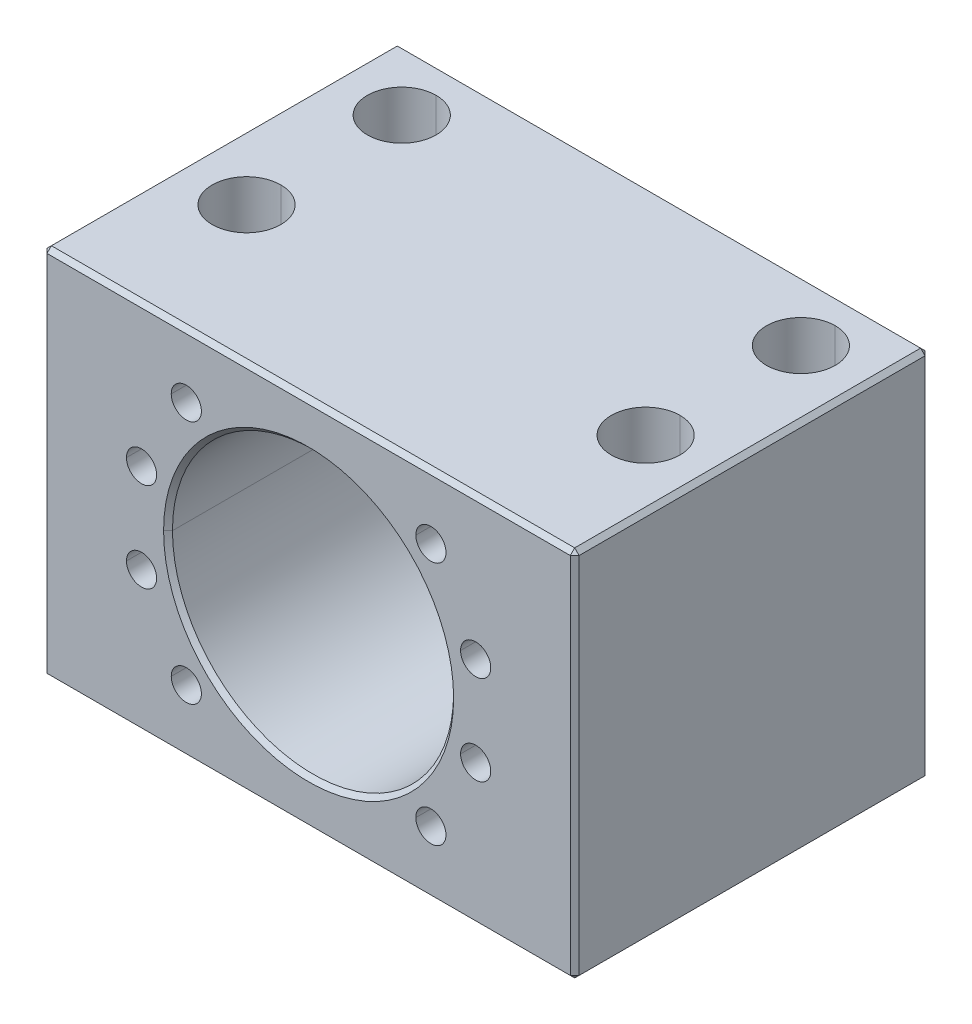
ISO-10303-21;
HEADER;
FILE_DESCRIPTION(('STEP AP214'),'2;1');
FILE_NAME('part.step','',(''),(''),'','','');
FILE_SCHEMA(('AUTOMOTIVE_DESIGN { 1 0 10303 214 1 1 1 1 }'));
ENDSEC;
DATA;
#1=APPLICATION_CONTEXT('core data for automotive mechanical design processes');
#2=APPLICATION_PROTOCOL_DEFINITION('international standard','automotive_design',2000,#1);
#3=PRODUCT_CONTEXT('',#1,'mechanical');
#4=PRODUCT('Part','Part','',(#3));
#5=PRODUCT_RELATED_PRODUCT_CATEGORY('part','',(#4));
#6=PRODUCT_DEFINITION_FORMATION('','',#4);
#7=PRODUCT_DEFINITION_CONTEXT('part definition',#1,'design');
#8=PRODUCT_DEFINITION('design','',#6,#7);
#9=PRODUCT_DEFINITION_SHAPE('','',#8);
#10=(LENGTH_UNIT() NAMED_UNIT(*) SI_UNIT(.MILLI.,.METRE.));
#11=(NAMED_UNIT(*) PLANE_ANGLE_UNIT() SI_UNIT($,.RADIAN.));
#12=(NAMED_UNIT(*) SI_UNIT($,.STERADIAN.) SOLID_ANGLE_UNIT());
#13=UNCERTAINTY_MEASURE_WITH_UNIT(LENGTH_MEASURE(1.E-05),#10,'distance_accuracy_value','');
#14=(GEOMETRIC_REPRESENTATION_CONTEXT(3) GLOBAL_UNCERTAINTY_ASSIGNED_CONTEXT((#13)) GLOBAL_UNIT_ASSIGNED_CONTEXT((#10,
#11,#12)) REPRESENTATION_CONTEXT('',''));
#15=CARTESIAN_POINT('',(0.,0.,0.));
#16=DIRECTION('',(0.,0.,1.));
#17=DIRECTION('',(1.,0.,0.));
#18=AXIS2_PLACEMENT_3D('',#15,#16,#17);
#19=CARTESIAN_POINT('',(45.,-17.5,9.));
#20=DIRECTION('',(0.,-1.,0.));
#21=DIRECTION('',(0.,0.,-1.));
#22=AXIS2_PLACEMENT_3D('',#19,#20,#21);
#23=PLANE('',#22);
#24=CARTESIAN_POINT('',(45.,-17.5,9.));
#25=DIRECTION('',(0.,-1.,0.));
#26=DIRECTION('',(0.,0.,-1.));
#27=AXIS2_PLACEMENT_3D('',#24,#25,#26);
#28=CIRCLE('',#27,7.5);
#29=CARTESIAN_POINT('',(45.,-17.5,1.5));
#30=VERTEX_POINT('',#29);
#31=CARTESIAN_POINT('',(45.,-17.5,16.5));
#32=VERTEX_POINT('',#31);
#33=EDGE_CURVE('E1098',#30,#32,#28,.T.);
#34=ORIENTED_EDGE('',*,*,#33,.F.);
#35=CARTESIAN_POINT('',(45.,-17.5,9.));
#36=DIRECTION('',(0.,1.,0.));
#37=DIRECTION('',(0.,0.,-1.));
#38=AXIS2_PLACEMENT_3D('',#35,#36,#37);
#39=CIRCLE('',#38,7.5);
#40=EDGE_CURVE('E1137',#30,#32,#39,.T.);
#41=ORIENTED_EDGE('',*,*,#40,.T.);
#42=EDGE_LOOP('',(#34,#41));
#43=FACE_BOUND('',#42,.T.);
#44=CARTESIAN_POINT('',(45.,-17.5,9.));
#45=DIRECTION('',(0.,-1.,0.));
#46=DIRECTION('',(0.,0.,-1.));
#47=AXIS2_PLACEMENT_3D('',#44,#45,#46);
#48=CIRCLE('',#47,11.);
#49=CARTESIAN_POINT('',(45.,-17.5,-2.));
#50=VERTEX_POINT('',#49);
#51=CARTESIAN_POINT('',(45.,-17.5,20.));
#52=VERTEX_POINT('',#51);
#53=EDGE_CURVE('E721',#50,#52,#48,.T.);
#54=ORIENTED_EDGE('',*,*,#53,.T.);
#55=CARTESIAN_POINT('',(45.,-17.5,9.));
#56=DIRECTION('',(0.,-1.,0.));
#57=DIRECTION('',(0.,0.,-1.));
#58=AXIS2_PLACEMENT_3D('',#55,#56,#57);
#59=CIRCLE('',#58,11.);
#60=EDGE_CURVE('E1029',#52,#50,#59,.T.);
#61=ORIENTED_EDGE('',*,*,#60,.T.);
#62=EDGE_LOOP('',(#54,#61));
#63=FACE_BOUND('',#62,.T.);
#64=ADVANCED_FACE('F16',(#43,#63),#23,.T.);
#65=CARTESIAN_POINT('',(45.,-17.5,-26.));
#66=DIRECTION('',(0.,-1.,0.));
#67=DIRECTION('',(0.,0.,-1.));
#68=AXIS2_PLACEMENT_3D('',#65,#66,#67);
#69=PLANE('',#68);
#70=CARTESIAN_POINT('',(45.,-17.5,-26.));
#71=DIRECTION('',(0.,-1.,0.));
#72=DIRECTION('',(0.,0.,-1.));
#73=AXIS2_PLACEMENT_3D('',#70,#71,#72);
#74=CIRCLE('',#73,7.5);
#75=CARTESIAN_POINT('',(45.,-17.5,-33.5));
#76=VERTEX_POINT('',#75);
#77=CARTESIAN_POINT('',(45.,-17.5,-18.5));
#78=VERTEX_POINT('',#77);
#79=EDGE_CURVE('E1133',#76,#78,#74,.T.);
#80=ORIENTED_EDGE('',*,*,#79,.F.);
#81=CARTESIAN_POINT('',(45.,-17.5,-26.));
#82=DIRECTION('',(0.,1.,0.));
#83=DIRECTION('',(0.,0.,-1.));
#84=AXIS2_PLACEMENT_3D('',#81,#82,#83);
#85=CIRCLE('',#84,7.5);
#86=EDGE_CURVE('E1222',#76,#78,#85,.T.);
#87=ORIENTED_EDGE('',*,*,#86,.T.);
#88=EDGE_LOOP('',(#80,#87));
#89=FACE_BOUND('',#88,.T.);
#90=CARTESIAN_POINT('',(45.,-17.5,-26.));
#91=DIRECTION('',(0.,-1.,0.));
#92=DIRECTION('',(0.,0.,-1.));
#93=AXIS2_PLACEMENT_3D('',#90,#91,#92);
#94=CIRCLE('',#93,11.);
#95=CARTESIAN_POINT('',(45.,-17.5,-37.));
#96=VERTEX_POINT('',#95);
#97=CARTESIAN_POINT('',(45.,-17.5,-15.));
#98=VERTEX_POINT('',#97);
#99=EDGE_CURVE('E722',#96,#98,#94,.T.);
#100=ORIENTED_EDGE('',*,*,#99,.T.);
#101=CARTESIAN_POINT('',(45.,-17.5,-26.));
#102=DIRECTION('',(0.,-1.,0.));
#103=DIRECTION('',(0.,0.,-1.));
#104=AXIS2_PLACEMENT_3D('',#101,#102,#103);
#105=CIRCLE('',#104,11.);
#106=EDGE_CURVE('E1030',#98,#96,#105,.T.);
#107=ORIENTED_EDGE('',*,*,#106,.T.);
#108=EDGE_LOOP('',(#100,#107));
#109=FACE_BOUND('',#108,.T.);
#110=ADVANCED_FACE('F1507',(#89,#109),#69,.T.);
#111=CARTESIAN_POINT('',(-45.,-17.5,9.));
#112=DIRECTION('',(0.,-1.,0.));
#113=DIRECTION('',(0.,0.,-1.));
#114=AXIS2_PLACEMENT_3D('',#111,#112,#113);
#115=PLANE('',#114);
#116=CARTESIAN_POINT('',(-45.,-17.5,9.));
#117=DIRECTION('',(0.,-1.,0.));
#118=DIRECTION('',(0.,0.,-1.));
#119=AXIS2_PLACEMENT_3D('',#116,#117,#118);
#120=CIRCLE('',#119,7.5);
#121=CARTESIAN_POINT('',(-45.,-17.5,1.5));
#122=VERTEX_POINT('',#121);
#123=CARTESIAN_POINT('',(-45.,-17.5,16.5));
#124=VERTEX_POINT('',#123);
#125=EDGE_CURVE('E1123',#122,#124,#120,.T.);
#126=ORIENTED_EDGE('',*,*,#125,.F.);
#127=CARTESIAN_POINT('',(-45.,-17.5,9.));
#128=DIRECTION('',(0.,1.,0.));
#129=DIRECTION('',(0.,0.,-1.));
#130=AXIS2_PLACEMENT_3D('',#127,#128,#129);
#131=CIRCLE('',#130,7.5);
#132=EDGE_CURVE('E1233',#122,#124,#131,.T.);
#133=ORIENTED_EDGE('',*,*,#132,.T.);
#134=EDGE_LOOP('',(#126,#133));
#135=FACE_BOUND('',#134,.T.);
#136=CARTESIAN_POINT('',(-45.,-17.5,9.));
#137=DIRECTION('',(0.,-1.,0.));
#138=DIRECTION('',(0.,0.,-1.));
#139=AXIS2_PLACEMENT_3D('',#136,#137,#138);
#140=CIRCLE('',#139,11.);
#141=CARTESIAN_POINT('',(-45.,-17.5,-2.));
#142=VERTEX_POINT('',#141);
#143=CARTESIAN_POINT('',(-45.,-17.5,20.));
#144=VERTEX_POINT('',#143);
#145=EDGE_CURVE('E725',#142,#144,#140,.T.);
#146=ORIENTED_EDGE('',*,*,#145,.T.);
#147=CARTESIAN_POINT('',(-45.,-17.5,9.));
#148=DIRECTION('',(0.,-1.,0.));
#149=DIRECTION('',(0.,0.,-1.));
#150=AXIS2_PLACEMENT_3D('',#147,#148,#149);
#151=CIRCLE('',#150,11.);
#152=EDGE_CURVE('E1039',#144,#142,#151,.T.);
#153=ORIENTED_EDGE('',*,*,#152,.T.);
#154=EDGE_LOOP('',(#146,#153));
#155=FACE_BOUND('',#154,.T.);
#156=ADVANCED_FACE('F1556',(#135,#155),#115,.T.);
#157=CARTESIAN_POINT('',(-45.,-17.5,-26.));
#158=DIRECTION('',(0.,-1.,0.));
#159=DIRECTION('',(0.,0.,-1.));
#160=AXIS2_PLACEMENT_3D('',#157,#158,#159);
#161=PLANE('',#160);
#162=CARTESIAN_POINT('',(-45.,-17.5,-26.));
#163=DIRECTION('',(0.,-1.,0.));
#164=DIRECTION('',(0.,0.,-1.));
#165=AXIS2_PLACEMENT_3D('',#162,#163,#164);
#166=CIRCLE('',#165,7.5);
#167=CARTESIAN_POINT('',(-45.,-17.5,-33.5));
#168=VERTEX_POINT('',#167);
#169=CARTESIAN_POINT('',(-45.,-17.5,-18.5));
#170=VERTEX_POINT('',#169);
#171=EDGE_CURVE('E1179',#168,#170,#166,.T.);
#172=ORIENTED_EDGE('',*,*,#171,.F.);
#173=CARTESIAN_POINT('',(-45.,-17.5,-26.));
#174=DIRECTION('',(0.,1.,0.));
#175=DIRECTION('',(0.,0.,-1.));
#176=AXIS2_PLACEMENT_3D('',#173,#174,#175);
#177=CIRCLE('',#176,7.5);
#178=EDGE_CURVE('E1201',#168,#170,#177,.T.);
#179=ORIENTED_EDGE('',*,*,#178,.T.);
#180=EDGE_LOOP('',(#172,#179));
#181=FACE_BOUND('',#180,.T.);
#182=CARTESIAN_POINT('',(-45.,-17.5,-26.));
#183=DIRECTION('',(0.,-1.,0.));
#184=DIRECTION('',(0.,0.,-1.));
#185=AXIS2_PLACEMENT_3D('',#182,#183,#184);
#186=CIRCLE('',#185,11.);
#187=CARTESIAN_POINT('',(-45.,-17.5,-37.));
#188=VERTEX_POINT('',#187);
#189=CARTESIAN_POINT('',(-45.,-17.5,-15.));
#190=VERTEX_POINT('',#189);
#191=EDGE_CURVE('E728',#188,#190,#186,.T.);
#192=ORIENTED_EDGE('',*,*,#191,.T.);
#193=CARTESIAN_POINT('',(-45.,-17.5,-26.));
#194=DIRECTION('',(0.,-1.,0.));
#195=DIRECTION('',(0.,0.,-1.));
#196=AXIS2_PLACEMENT_3D('',#193,#194,#195);
#197=CIRCLE('',#196,11.);
#198=EDGE_CURVE('E1001',#190,#188,#197,.T.);
#199=ORIENTED_EDGE('',*,*,#198,.T.);
#200=EDGE_LOOP('',(#192,#199));
#201=FACE_BOUND('',#200,.T.);
#202=ADVANCED_FACE('F1564',(#181,#201),#161,.T.);
#203=CARTESIAN_POINT('',(0.,0.,39.));
#204=DIRECTION('',(0.,0.,1.));
#205=DIRECTION('',(1.,0.,0.));
#206=AXIS2_PLACEMENT_3D('',#203,#204,#205);
#207=CONICAL_SURFACE('',#206,31.7,0.785398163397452);
#208=CARTESIAN_POINT('',(0.,0.,39.));
#209=DIRECTION('',(0.,0.,-1.));
#210=DIRECTION('',(1.,0.,0.));
#211=AXIS2_PLACEMENT_3D('',#208,#209,#210);
#212=CIRCLE('',#211,31.7);
#213=CARTESIAN_POINT('',(31.7,0.,39.));
#214=VERTEX_POINT('',#213);
#215=CARTESIAN_POINT('',(-31.7,0.,39.));
#216=VERTEX_POINT('',#215);
#217=EDGE_CURVE('E10',#214,#216,#212,.T.);
#218=ORIENTED_EDGE('',*,*,#217,.T.);
#219=DIRECTION('',(-0.707106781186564,0.,0.707106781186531));
#220=VECTOR('',#219,1.);
#221=CARTESIAN_POINT('',(-31.7,0.,39.));
#222=LINE('',#221,#220);
#223=CARTESIAN_POINT('',(-32.7,0.,40.));
#224=VERTEX_POINT('',#223);
#225=EDGE_CURVE('E1136',#216,#224,#222,.T.);
#226=ORIENTED_EDGE('',*,*,#225,.T.);
#227=CARTESIAN_POINT('',(0.,0.,40.));
#228=DIRECTION('',(0.,0.,1.));
#229=DIRECTION('',(1.,0.,0.));
#230=AXIS2_PLACEMENT_3D('',#227,#228,#229);
#231=CIRCLE('',#230,32.7);
#232=CARTESIAN_POINT('',(32.7,0.,40.));
#233=VERTEX_POINT('',#232);
#234=EDGE_CURVE('E1142',#224,#233,#231,.T.);
#235=ORIENTED_EDGE('',*,*,#234,.T.);
#236=DIRECTION('',(0.707106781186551,0.,0.707106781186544));
#237=VECTOR('',#236,1.);
#238=CARTESIAN_POINT('',(31.7,0.,39.));
#239=LINE('',#238,#237);
#240=EDGE_CURVE('E1255',#214,#233,#239,.T.);
#241=ORIENTED_EDGE('',*,*,#240,.F.);
#242=EDGE_LOOP('',(#218,#226,#235,#241));
#243=FACE_BOUND('',#242,.T.);
#244=ADVANCED_FACE('F18',(#243),#207,.F.);
#245=CARTESIAN_POINT('',(0.,0.,-39.));
#246=DIRECTION('',(0.,0.,1.));
#247=DIRECTION('',(1.,0.,0.));
#248=AXIS2_PLACEMENT_3D('',#245,#246,#247);
#249=CYLINDRICAL_SURFACE('',#248,31.7);
#250=CARTESIAN_POINT('',(0.,0.,-39.));
#251=DIRECTION('',(0.,0.,-1.));
#252=DIRECTION('',(1.,0.,0.));
#253=AXIS2_PLACEMENT_3D('',#250,#251,#252);
#254=CIRCLE('',#253,31.7);
#255=CARTESIAN_POINT('',(31.7,0.,-39.));
#256=VERTEX_POINT('',#255);
#257=CARTESIAN_POINT('',(-31.7,0.,-39.));
#258=VERTEX_POINT('',#257);
#259=EDGE_CURVE('E26',#256,#258,#254,.T.);
#260=ORIENTED_EDGE('',*,*,#259,.T.);
#261=DIRECTION('',(0.,0.,1.));
#262=VECTOR('',#261,1.);
#263=CARTESIAN_POINT('',(-31.7,0.,-39.));
#264=LINE('',#263,#262);
#265=EDGE_CURVE('E1294',#258,#216,#264,.T.);
#266=ORIENTED_EDGE('',*,*,#265,.T.);
#267=ORIENTED_EDGE('',*,*,#217,.F.);
#268=DIRECTION('',(0.,0.,1.));
#269=VECTOR('',#268,1.);
#270=CARTESIAN_POINT('',(31.7,0.,-39.));
#271=LINE('',#270,#269);
#272=EDGE_CURVE('E994',#256,#214,#271,.T.);
#273=ORIENTED_EDGE('',*,*,#272,.F.);
#274=EDGE_LOOP('',(#260,#266,#267,#273));
#275=FACE_BOUND('',#274,.T.);
#276=ADVANCED_FACE('F1568',(#275),#249,.F.);
#277=CARTESIAN_POINT('',(27.577164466,-27.577164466,18.));
#278=DIRECTION('',(0.,0.,1.));
#279=DIRECTION('',(1.,0.,0.));
#280=AXIS2_PLACEMENT_3D('',#277,#278,#279);
#281=CYLINDRICAL_SURFACE('',#280,3.4);
#282=CARTESIAN_POINT('',(27.577164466,-27.577164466,18.));
#283=DIRECTION('',(0.,0.,-1.));
#284=DIRECTION('',(1.,0.,0.));
#285=AXIS2_PLACEMENT_3D('',#282,#283,#284);
#286=CIRCLE('',#285,3.4);
#287=CARTESIAN_POINT('',(30.9771644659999,-27.577164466,18.));
#288=VERTEX_POINT('',#287);
#289=CARTESIAN_POINT('',(24.1771644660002,-27.577164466,18.));
#290=VERTEX_POINT('',#289);
#291=EDGE_CURVE('E756',#288,#290,#286,.T.);
#292=ORIENTED_EDGE('',*,*,#291,.T.);
#293=DIRECTION('',(0.,0.,1.));
#294=VECTOR('',#293,1.);
#295=CARTESIAN_POINT('',(24.177164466,-27.577164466,18.));
#296=LINE('',#295,#294);
#297=CARTESIAN_POINT('',(24.177164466,-27.577164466,40.));
#298=VERTEX_POINT('',#297);
#299=EDGE_CURVE('E1347',#290,#298,#296,.T.);
#300=ORIENTED_EDGE('',*,*,#299,.T.);
#301=CARTESIAN_POINT('',(27.577164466,-27.577164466,40.));
#302=DIRECTION('',(0.,0.,-1.));
#303=DIRECTION('',(1.,0.,0.));
#304=AXIS2_PLACEMENT_3D('',#301,#302,#303);
#305=CIRCLE('',#304,3.4);
#306=CARTESIAN_POINT('',(30.977164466,-27.577164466,40.));
#307=VERTEX_POINT('',#306);
#308=EDGE_CURVE('E1332',#307,#298,#305,.T.);
#309=ORIENTED_EDGE('',*,*,#308,.F.);
#310=DIRECTION('',(0.,0.,1.));
#311=VECTOR('',#310,1.);
#312=CARTESIAN_POINT('',(30.977164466,-27.577164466,18.));
#313=LINE('',#312,#311);
#314=EDGE_CURVE('E1354',#288,#307,#313,.T.);
#315=ORIENTED_EDGE('',*,*,#314,.F.);
#316=EDGE_LOOP('',(#292,#300,#309,#315));
#317=FACE_BOUND('',#316,.T.);
#318=ADVANCED_FACE('F1571',(#317),#281,.F.);
#319=CARTESIAN_POINT('',(27.577164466,27.577164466,18.));
#320=DIRECTION('',(0.,0.,1.));
#321=DIRECTION('',(1.,0.,0.));
#322=AXIS2_PLACEMENT_3D('',#319,#320,#321);
#323=CYLINDRICAL_SURFACE('',#322,3.4);
#324=CARTESIAN_POINT('',(27.577164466,27.577164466,18.));
#325=DIRECTION('',(0.,0.,-1.));
#326=DIRECTION('',(1.,0.,0.));
#327=AXIS2_PLACEMENT_3D('',#324,#325,#326);
#328=CIRCLE('',#327,3.4);
#329=CARTESIAN_POINT('',(30.9771644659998,27.577164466,18.));
#330=VERTEX_POINT('',#329);
#331=CARTESIAN_POINT('',(24.1771644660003,27.5771644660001,18.));
#332=VERTEX_POINT('',#331);
#333=EDGE_CURVE('E20',#330,#332,#328,.T.);
#334=ORIENTED_EDGE('',*,*,#333,.T.);
#335=DIRECTION('',(0.,0.,1.));
#336=VECTOR('',#335,1.);
#337=CARTESIAN_POINT('',(24.177164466,27.577164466,18.));
#338=LINE('',#337,#336);
#339=CARTESIAN_POINT('',(24.177164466,27.577164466,40.));
#340=VERTEX_POINT('',#339);
#341=EDGE_CURVE('E1239',#332,#340,#338,.T.);
#342=ORIENTED_EDGE('',*,*,#341,.T.);
#343=CARTESIAN_POINT('',(27.577164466,27.577164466,40.));
#344=DIRECTION('',(0.,0.,-1.));
#345=DIRECTION('',(1.,0.,0.));
#346=AXIS2_PLACEMENT_3D('',#343,#344,#345);
#347=CIRCLE('',#346,3.4);
#348=CARTESIAN_POINT('',(30.977164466,27.577164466,40.));
#349=VERTEX_POINT('',#348);
#350=EDGE_CURVE('E1318',#349,#340,#347,.T.);
#351=ORIENTED_EDGE('',*,*,#350,.F.);
#352=DIRECTION('',(0.,0.,1.));
#353=VECTOR('',#352,1.);
#354=CARTESIAN_POINT('',(30.977164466,27.577164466,18.));
#355=LINE('',#354,#353);
#356=EDGE_CURVE('E1238',#330,#349,#355,.T.);
#357=ORIENTED_EDGE('',*,*,#356,.F.);
#358=EDGE_LOOP('',(#334,#342,#351,#357));
#359=FACE_BOUND('',#358,.T.);
#360=ADVANCED_FACE('F1594',(#359),#323,.F.);
#361=CARTESIAN_POINT('',(37.671107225,-10.093942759,18.));
#362=DIRECTION('',(0.,0.,1.));
#363=DIRECTION('',(1.,0.,0.));
#364=AXIS2_PLACEMENT_3D('',#361,#362,#363);
#365=CYLINDRICAL_SURFACE('',#364,3.4);
#366=CARTESIAN_POINT('',(37.671107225,-10.093942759,18.));
#367=DIRECTION('',(0.,0.,-1.));
#368=DIRECTION('',(1.,0.,0.));
#369=AXIS2_PLACEMENT_3D('',#366,#367,#368);
#370=CIRCLE('',#369,3.4);
#371=CARTESIAN_POINT('',(41.071107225,-10.0939427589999,18.));
#372=VERTEX_POINT('',#371);
#373=CARTESIAN_POINT('',(34.2711072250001,-10.0939427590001,18.));
#374=VERTEX_POINT('',#373);
#375=EDGE_CURVE('E748',#372,#374,#370,.T.);
#376=ORIENTED_EDGE('',*,*,#375,.T.);
#377=DIRECTION('',(0.,0.,1.));
#378=VECTOR('',#377,1.);
#379=CARTESIAN_POINT('',(34.271107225,-10.093942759,18.));
#380=LINE('',#379,#378);
#381=CARTESIAN_POINT('',(34.271107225,-10.093942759,40.));
#382=VERTEX_POINT('',#381);
#383=EDGE_CURVE('E1319',#374,#382,#380,.T.);
#384=ORIENTED_EDGE('',*,*,#383,.T.);
#385=CARTESIAN_POINT('',(37.671107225,-10.093942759,40.));
#386=DIRECTION('',(0.,0.,-1.));
#387=DIRECTION('',(1.,0.,0.));
#388=AXIS2_PLACEMENT_3D('',#385,#386,#387);
#389=CIRCLE('',#388,3.4);
#390=CARTESIAN_POINT('',(41.071107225,-10.093942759,40.));
#391=VERTEX_POINT('',#390);
#392=EDGE_CURVE('E1044',#391,#382,#389,.T.);
#393=ORIENTED_EDGE('',*,*,#392,.F.);
#394=DIRECTION('',(0.,0.,1.));
#395=VECTOR('',#394,1.);
#396=CARTESIAN_POINT('',(41.071107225,-10.093942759,18.));
#397=LINE('',#396,#395);
#398=EDGE_CURVE('E1288',#372,#391,#397,.T.);
#399=ORIENTED_EDGE('',*,*,#398,.F.);
#400=EDGE_LOOP('',(#376,#384,#393,#399));
#401=FACE_BOUND('',#400,.T.);
#402=ADVANCED_FACE('F1597',(#401),#365,.F.);
#403=CARTESIAN_POINT('',(37.671107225,10.093942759,18.));
#404=DIRECTION('',(0.,0.,1.));
#405=DIRECTION('',(1.,0.,0.));
#406=AXIS2_PLACEMENT_3D('',#403,#404,#405);
#407=CYLINDRICAL_SURFACE('',#406,3.4);
#408=CARTESIAN_POINT('',(37.671107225,10.093942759,18.));
#409=DIRECTION('',(0.,0.,-1.));
#410=DIRECTION('',(1.,0.,0.));
#411=AXIS2_PLACEMENT_3D('',#408,#409,#410);
#412=CIRCLE('',#411,3.4);
#413=CARTESIAN_POINT('',(41.071107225,10.0939427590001,18.));
#414=VERTEX_POINT('',#413);
#415=CARTESIAN_POINT('',(34.2711072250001,10.0939427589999,18.));
#416=VERTEX_POINT('',#415);
#417=EDGE_CURVE('E746',#414,#416,#412,.T.);
#418=ORIENTED_EDGE('',*,*,#417,.T.);
#419=DIRECTION('',(0.,0.,1.));
#420=VECTOR('',#419,1.);
#421=CARTESIAN_POINT('',(34.271107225,10.093942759,18.));
#422=LINE('',#421,#420);
#423=CARTESIAN_POINT('',(34.271107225,10.093942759,40.));
#424=VERTEX_POINT('',#423);
#425=EDGE_CURVE('E1206',#416,#424,#422,.T.);
#426=ORIENTED_EDGE('',*,*,#425,.T.);
#427=CARTESIAN_POINT('',(37.671107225,10.093942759,40.));
#428=DIRECTION('',(0.,0.,-1.));
#429=DIRECTION('',(1.,0.,0.));
#430=AXIS2_PLACEMENT_3D('',#427,#428,#429);
#431=CIRCLE('',#430,3.4);
#432=CARTESIAN_POINT('',(41.071107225,10.093942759,40.));
#433=VERTEX_POINT('',#432);
#434=EDGE_CURVE('E1045',#433,#424,#431,.T.);
#435=ORIENTED_EDGE('',*,*,#434,.F.);
#436=DIRECTION('',(0.,0.,1.));
#437=VECTOR('',#436,1.);
#438=CARTESIAN_POINT('',(41.071107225,10.093942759,18.));
#439=LINE('',#438,#437);
#440=EDGE_CURVE('E1107',#414,#433,#439,.T.);
#441=ORIENTED_EDGE('',*,*,#440,.F.);
#442=EDGE_LOOP('',(#418,#426,#435,#441));
#443=FACE_BOUND('',#442,.T.);
#444=ADVANCED_FACE('F1680',(#443),#407,.F.);
#445=CARTESIAN_POINT('',(-27.577164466,27.577164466,18.));
#446=DIRECTION('',(0.,0.,1.));
#447=DIRECTION('',(1.,0.,0.));
#448=AXIS2_PLACEMENT_3D('',#445,#446,#447);
#449=CYLINDRICAL_SURFACE('',#448,3.4);
#450=CARTESIAN_POINT('',(-27.577164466,27.577164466,18.));
#451=DIRECTION('',(0.,0.,-1.));
#452=DIRECTION('',(1.,0.,0.));
#453=AXIS2_PLACEMENT_3D('',#450,#451,#452);
#454=CIRCLE('',#453,3.4);
#455=CARTESIAN_POINT('',(-24.177164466,27.5771644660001,18.));
#456=VERTEX_POINT('',#455);
#457=CARTESIAN_POINT('',(-30.9771644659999,27.5771644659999,18.));
#458=VERTEX_POINT('',#457);
#459=EDGE_CURVE('E743',#456,#458,#454,.T.);
#460=ORIENTED_EDGE('',*,*,#459,.T.);
#461=DIRECTION('',(0.,0.,1.));
#462=VECTOR('',#461,1.);
#463=CARTESIAN_POINT('',(-30.977164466,27.577164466,18.));
#464=LINE('',#463,#462);
#465=CARTESIAN_POINT('',(-30.977164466,27.577164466,40.));
#466=VERTEX_POINT('',#465);
#467=EDGE_CURVE('E1103',#458,#466,#464,.T.);
#468=ORIENTED_EDGE('',*,*,#467,.T.);
#469=CARTESIAN_POINT('',(-27.577164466,27.577164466,40.));
#470=DIRECTION('',(0.,0.,-1.));
#471=DIRECTION('',(1.,0.,0.));
#472=AXIS2_PLACEMENT_3D('',#469,#470,#471);
#473=CIRCLE('',#472,3.4);
#474=CARTESIAN_POINT('',(-24.177164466,27.577164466,40.));
#475=VERTEX_POINT('',#474);
#476=EDGE_CURVE('E1225',#475,#466,#473,.T.);
#477=ORIENTED_EDGE('',*,*,#476,.F.);
#478=DIRECTION('',(0.,0.,1.));
#479=VECTOR('',#478,1.);
#480=CARTESIAN_POINT('',(-24.177164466,27.577164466,18.));
#481=LINE('',#480,#479);
#482=EDGE_CURVE('E1215',#456,#475,#481,.T.);
#483=ORIENTED_EDGE('',*,*,#482,.F.);
#484=EDGE_LOOP('',(#460,#468,#477,#483));
#485=FACE_BOUND('',#484,.T.);
#486=ADVANCED_FACE('F1677',(#485),#449,.F.);
#487=CARTESIAN_POINT('',(-27.577164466,-27.577164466,18.));
#488=DIRECTION('',(0.,0.,1.));
#489=DIRECTION('',(1.,0.,0.));
#490=AXIS2_PLACEMENT_3D('',#487,#488,#489);
#491=CYLINDRICAL_SURFACE('',#490,3.4);
#492=CARTESIAN_POINT('',(-27.577164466,-27.577164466,18.));
#493=DIRECTION('',(0.,0.,-1.));
#494=DIRECTION('',(1.,0.,0.));
#495=AXIS2_PLACEMENT_3D('',#492,#493,#494);
#496=CIRCLE('',#495,3.4);
#497=CARTESIAN_POINT('',(-24.177164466,-27.5771644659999,18.));
#498=VERTEX_POINT('',#497);
#499=CARTESIAN_POINT('',(-30.9771644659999,-27.5771644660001,18.));
#500=VERTEX_POINT('',#499);
#501=EDGE_CURVE('E740',#498,#500,#496,.T.);
#502=ORIENTED_EDGE('',*,*,#501,.T.);
#503=DIRECTION('',(0.,0.,1.));
#504=VECTOR('',#503,1.);
#505=CARTESIAN_POINT('',(-30.977164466,-27.577164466,18.));
#506=LINE('',#505,#504);
#507=CARTESIAN_POINT('',(-30.977164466,-27.577164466,40.));
#508=VERTEX_POINT('',#507);
#509=EDGE_CURVE('E1218',#500,#508,#506,.T.);
#510=ORIENTED_EDGE('',*,*,#509,.T.);
#511=CARTESIAN_POINT('',(-27.577164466,-27.577164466,40.));
#512=DIRECTION('',(0.,0.,-1.));
#513=DIRECTION('',(1.,0.,0.));
#514=AXIS2_PLACEMENT_3D('',#511,#512,#513);
#515=CIRCLE('',#514,3.4);
#516=CARTESIAN_POINT('',(-24.177164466,-27.577164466,40.));
#517=VERTEX_POINT('',#516);
#518=EDGE_CURVE('E1091',#517,#508,#515,.T.);
#519=ORIENTED_EDGE('',*,*,#518,.F.);
#520=DIRECTION('',(0.,0.,1.));
#521=VECTOR('',#520,1.);
#522=CARTESIAN_POINT('',(-24.177164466,-27.577164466,18.));
#523=LINE('',#522,#521);
#524=EDGE_CURVE('E773',#498,#517,#523,.T.);
#525=ORIENTED_EDGE('',*,*,#524,.F.);
#526=EDGE_LOOP('',(#502,#510,#519,#525));
#527=FACE_BOUND('',#526,.T.);
#528=ADVANCED_FACE('F1394',(#527),#491,.F.);
#529=CARTESIAN_POINT('',(-37.671107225,10.093942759,18.));
#530=DIRECTION('',(0.,0.,1.));
#531=DIRECTION('',(1.,0.,0.));
#532=AXIS2_PLACEMENT_3D('',#529,#530,#531);
#533=CYLINDRICAL_SURFACE('',#532,3.4);
#534=CARTESIAN_POINT('',(-37.671107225,10.093942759,18.));
#535=DIRECTION('',(0.,0.,-1.));
#536=DIRECTION('',(1.,0.,0.));
#537=AXIS2_PLACEMENT_3D('',#534,#535,#536);
#538=CIRCLE('',#537,3.4);
#539=CARTESIAN_POINT('',(-34.271107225,10.0939427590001,18.));
#540=VERTEX_POINT('',#539);
#541=CARTESIAN_POINT('',(-41.0711072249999,10.0939427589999,18.));
#542=VERTEX_POINT('',#541);
#543=EDGE_CURVE('E737',#540,#542,#538,.T.);
#544=ORIENTED_EDGE('',*,*,#543,.T.);
#545=DIRECTION('',(0.,0.,1.));
#546=VECTOR('',#545,1.);
#547=CARTESIAN_POINT('',(-41.071107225,10.093942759,18.));
#548=LINE('',#547,#546);
#549=CARTESIAN_POINT('',(-41.071107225,10.093942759,40.));
#550=VERTEX_POINT('',#549);
#551=EDGE_CURVE('E1009',#542,#550,#548,.T.);
#552=ORIENTED_EDGE('',*,*,#551,.T.);
#553=CARTESIAN_POINT('',(-37.671107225,10.093942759,40.));
#554=DIRECTION('',(0.,0.,-1.));
#555=DIRECTION('',(1.,0.,0.));
#556=AXIS2_PLACEMENT_3D('',#553,#554,#555);
#557=CIRCLE('',#556,3.4);
#558=CARTESIAN_POINT('',(-34.271107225,10.093942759,40.));
#559=VERTEX_POINT('',#558);
#560=EDGE_CURVE('E1078',#559,#550,#557,.T.);
#561=ORIENTED_EDGE('',*,*,#560,.F.);
#562=DIRECTION('',(0.,0.,1.));
#563=VECTOR('',#562,1.);
#564=CARTESIAN_POINT('',(-34.271107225,10.093942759,18.));
#565=LINE('',#564,#563);
#566=EDGE_CURVE('E779',#540,#559,#565,.T.);
#567=ORIENTED_EDGE('',*,*,#566,.F.);
#568=EDGE_LOOP('',(#544,#552,#561,#567));
#569=FACE_BOUND('',#568,.T.);
#570=ADVANCED_FACE('F1820',(#569),#533,.F.);
#571=CARTESIAN_POINT('',(-37.671107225,-10.093942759,18.));
#572=DIRECTION('',(0.,0.,1.));
#573=DIRECTION('',(1.,0.,0.));
#574=AXIS2_PLACEMENT_3D('',#571,#572,#573);
#575=CYLINDRICAL_SURFACE('',#574,3.4);
#576=CARTESIAN_POINT('',(-37.671107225,-10.093942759,18.));
#577=DIRECTION('',(0.,0.,-1.));
#578=DIRECTION('',(1.,0.,0.));
#579=AXIS2_PLACEMENT_3D('',#576,#577,#578);
#580=CIRCLE('',#579,3.4);
#581=CARTESIAN_POINT('',(-34.271107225,-10.0939427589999,18.));
#582=VERTEX_POINT('',#581);
#583=CARTESIAN_POINT('',(-41.0711072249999,-10.0939427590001,18.));
#584=VERTEX_POINT('',#583);
#585=EDGE_CURVE('E566',#582,#584,#580,.T.);
#586=ORIENTED_EDGE('',*,*,#585,.T.);
#587=DIRECTION('',(0.,0.,1.));
#588=VECTOR('',#587,1.);
#589=CARTESIAN_POINT('',(-41.071107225,-10.093942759,18.));
#590=LINE('',#589,#588);
#591=CARTESIAN_POINT('',(-41.071107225,-10.093942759,40.));
#592=VERTEX_POINT('',#591);
#593=EDGE_CURVE('E775',#584,#592,#590,.T.);
#594=ORIENTED_EDGE('',*,*,#593,.T.);
#595=CARTESIAN_POINT('',(-37.671107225,-10.093942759,40.));
#596=DIRECTION('',(0.,0.,-1.));
#597=DIRECTION('',(1.,0.,0.));
#598=AXIS2_PLACEMENT_3D('',#595,#596,#597);
#599=CIRCLE('',#598,3.4);
#600=CARTESIAN_POINT('',(-34.271107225,-10.093942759,40.));
#601=VERTEX_POINT('',#600);
#602=EDGE_CURVE('E1079',#601,#592,#599,.T.);
#603=ORIENTED_EDGE('',*,*,#602,.F.);
#604=DIRECTION('',(0.,0.,1.));
#605=VECTOR('',#604,1.);
#606=CARTESIAN_POINT('',(-34.271107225,-10.093942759,18.));
#607=LINE('',#606,#605);
#608=EDGE_CURVE('E783',#582,#601,#607,.T.);
#609=ORIENTED_EDGE('',*,*,#608,.F.);
#610=EDGE_LOOP('',(#586,#594,#603,#609));
#611=FACE_BOUND('',#610,.T.);
#612=ADVANCED_FACE('F2817',(#611),#575,.F.);
#613=CARTESIAN_POINT('',(0.,0.,-39.));
#614=DIRECTION('',(0.,0.,-1.));
#615=DIRECTION('',(-1.,0.,0.));
#616=AXIS2_PLACEMENT_3D('',#613,#614,#615);
#617=CONICAL_SURFACE('',#616,31.7,0.785398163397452);
#618=ORIENTED_EDGE('',*,*,#259,.F.);
#619=DIRECTION('',(0.707106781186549,0.,-0.707106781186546));
#620=VECTOR('',#619,1.);
#621=CARTESIAN_POINT('',(31.7,0.,-39.));
#622=LINE('',#621,#620);
#623=CARTESIAN_POINT('',(32.7,0.,-40.));
#624=VERTEX_POINT('',#623);
#625=EDGE_CURVE('E812',#256,#624,#622,.T.);
#626=ORIENTED_EDGE('',*,*,#625,.T.);
#627=CARTESIAN_POINT('',(0.,0.,-40.));
#628=DIRECTION('',(0.,0.,-1.));
#629=DIRECTION('',(-1.,0.,0.));
#630=AXIS2_PLACEMENT_3D('',#627,#628,#629);
#631=CIRCLE('',#630,32.7);
#632=CARTESIAN_POINT('',(-32.7,0.,-40.));
#633=VERTEX_POINT('',#632);
#634=EDGE_CURVE('E592',#624,#633,#631,.T.);
#635=ORIENTED_EDGE('',*,*,#634,.T.);
#636=DIRECTION('',(-0.707106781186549,0.,-0.707106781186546));
#637=VECTOR('',#636,1.);
#638=CARTESIAN_POINT('',(-31.7,0.,-39.));
#639=LINE('',#638,#637);
#640=EDGE_CURVE('E824',#258,#633,#639,.T.);
#641=ORIENTED_EDGE('',*,*,#640,.F.);
#642=EDGE_LOOP('',(#618,#626,#635,#641));
#643=FACE_BOUND('',#642,.T.);
#644=ADVANCED_FACE('F1695',(#643),#617,.F.);
#645=CARTESIAN_POINT('',(27.577164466,-27.577164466,1015.957073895));
#646=DIRECTION('',(0.,0.,1.));
#647=DIRECTION('',(1.,0.,0.));
#648=AXIS2_PLACEMENT_3D('',#645,#646,#647);
#649=CONICAL_SURFACE('',#648,1664.27948210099,1.02974425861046);
#650=DIRECTION('',(0.857167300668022,0.,0.51503807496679));
#651=VECTOR('',#650,1.);
#652=CARTESIAN_POINT('',(27.577164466,-27.577164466,15.957073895));
#653=LINE('',#652,#651);
#654=CARTESIAN_POINT('',(27.577164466,-27.577164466,15.957073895));
#655=VERTEX_POINT('',#654);
#656=EDGE_CURVE('E827',#655,#288,#653,.T.);
#657=ORIENTED_EDGE('',*,*,#656,.F.);
#658=DIRECTION('',(-0.857167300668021,0.,0.515038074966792));
#659=VECTOR('',#658,1.);
#660=CARTESIAN_POINT('',(27.577164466,-27.577164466,15.957073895));
#661=LINE('',#660,#659);
#662=EDGE_CURVE('E823',#655,#290,#661,.T.);
#663=ORIENTED_EDGE('',*,*,#662,.T.);
#664=ORIENTED_EDGE('',*,*,#291,.F.);
#665=EDGE_LOOP('',(#657,#663,#664));
#666=FACE_BOUND('',#665,.T.);
#667=ADVANCED_FACE('F1691',(#666),#649,.F.);
#668=CARTESIAN_POINT('',(27.577164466,27.577164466,1015.957073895));
#669=DIRECTION('',(0.,0.,1.));
#670=DIRECTION('',(1.,0.,0.));
#671=AXIS2_PLACEMENT_3D('',#668,#669,#670);
#672=CONICAL_SURFACE('',#671,1664.27948210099,1.02974425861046);
#673=DIRECTION('',(0.857167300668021,0.,0.515038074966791));
#674=VECTOR('',#673,1.);
#675=CARTESIAN_POINT('',(27.577164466,27.577164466,15.957073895));
#676=LINE('',#675,#674);
#677=CARTESIAN_POINT('',(27.577164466,27.577164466,15.957073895));
#678=VERTEX_POINT('',#677);
#679=EDGE_CURVE('E838',#678,#330,#676,.T.);
#680=ORIENTED_EDGE('',*,*,#679,.F.);
#681=DIRECTION('',(-0.857167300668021,0.,0.515038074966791));
#682=VECTOR('',#681,1.);
#683=CARTESIAN_POINT('',(27.577164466,27.577164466,15.957073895));
#684=LINE('',#683,#682);
#685=EDGE_CURVE('E843',#678,#332,#684,.T.);
#686=ORIENTED_EDGE('',*,*,#685,.T.);
#687=ORIENTED_EDGE('',*,*,#333,.F.);
#688=EDGE_LOOP('',(#680,#686,#687));
#689=FACE_BOUND('',#688,.T.);
#690=ADVANCED_FACE('F1694',(#689),#672,.F.);
#691=CARTESIAN_POINT('',(37.671107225,-10.093942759,1015.957073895));
#692=DIRECTION('',(0.,0.,1.));
#693=DIRECTION('',(1.,0.,0.));
#694=AXIS2_PLACEMENT_3D('',#691,#692,#693);
#695=CONICAL_SURFACE('',#694,1664.27948210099,1.02974425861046);
#696=DIRECTION('',(0.857167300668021,0.,0.515038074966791));
#697=VECTOR('',#696,1.);
#698=CARTESIAN_POINT('',(37.671107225,-10.093942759,15.957073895));
#699=LINE('',#698,#697);
#700=CARTESIAN_POINT('',(37.671107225,-10.093942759,15.9570738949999));
#701=VERTEX_POINT('',#700);
#702=EDGE_CURVE('E818',#701,#372,#699,.T.);
#703=ORIENTED_EDGE('',*,*,#702,.F.);
#704=DIRECTION('',(-0.857167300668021,0.,0.515038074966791));
#705=VECTOR('',#704,1.);
#706=CARTESIAN_POINT('',(37.671107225,-10.093942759,15.957073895));
#707=LINE('',#706,#705);
#708=EDGE_CURVE('E842',#701,#374,#707,.T.);
#709=ORIENTED_EDGE('',*,*,#708,.T.);
#710=ORIENTED_EDGE('',*,*,#375,.F.);
#711=EDGE_LOOP('',(#703,#709,#710));
#712=FACE_BOUND('',#711,.T.);
#713=ADVANCED_FACE('F1836',(#712),#695,.F.);
#714=CARTESIAN_POINT('',(37.671107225,10.093942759,1015.957073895));
#715=DIRECTION('',(0.,0.,1.));
#716=DIRECTION('',(1.,0.,0.));
#717=AXIS2_PLACEMENT_3D('',#714,#715,#716);
#718=CONICAL_SURFACE('',#717,1664.27948210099,1.02974425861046);
#719=DIRECTION('',(0.857167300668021,0.,0.515038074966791));
#720=VECTOR('',#719,1.);
#721=CARTESIAN_POINT('',(37.671107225,10.093942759,15.957073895));
#722=LINE('',#721,#720);
#723=CARTESIAN_POINT('',(37.671107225,10.093942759,15.9570738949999));
#724=VERTEX_POINT('',#723);
#725=EDGE_CURVE('E817',#724,#414,#722,.T.);
#726=ORIENTED_EDGE('',*,*,#725,.F.);
#727=DIRECTION('',(-0.857167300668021,0.,0.515038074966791));
#728=VECTOR('',#727,1.);
#729=CARTESIAN_POINT('',(37.671107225,10.093942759,15.957073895));
#730=LINE('',#729,#728);
#731=EDGE_CURVE('E813',#724,#416,#730,.T.);
#732=ORIENTED_EDGE('',*,*,#731,.T.);
#733=ORIENTED_EDGE('',*,*,#417,.F.);
#734=EDGE_LOOP('',(#726,#732,#733));
#735=FACE_BOUND('',#734,.T.);
#736=ADVANCED_FACE('F1833',(#735),#718,.F.);
#737=CARTESIAN_POINT('',(-27.577164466,27.577164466,1015.957073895));
#738=DIRECTION('',(0.,0.,1.));
#739=DIRECTION('',(1.,0.,0.));
#740=AXIS2_PLACEMENT_3D('',#737,#738,#739);
#741=CONICAL_SURFACE('',#740,1664.27948210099,1.02974425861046);
#742=DIRECTION('',(0.857167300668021,0.,0.515038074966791));
#743=VECTOR('',#742,1.);
#744=CARTESIAN_POINT('',(-27.577164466,27.577164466,15.957073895));
#745=LINE('',#744,#743);
#746=CARTESIAN_POINT('',(-27.577164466,27.577164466,15.9570738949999));
#747=VERTEX_POINT('',#746);
#748=EDGE_CURVE('E789',#747,#456,#745,.T.);
#749=ORIENTED_EDGE('',*,*,#748,.F.);
#750=DIRECTION('',(-0.857167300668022,0.,0.51503807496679));
#751=VECTOR('',#750,1.);
#752=CARTESIAN_POINT('',(-27.577164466,27.577164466,15.957073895));
#753=LINE('',#752,#751);
#754=EDGE_CURVE('E837',#747,#458,#753,.T.);
#755=ORIENTED_EDGE('',*,*,#754,.T.);
#756=ORIENTED_EDGE('',*,*,#459,.F.);
#757=EDGE_LOOP('',(#749,#755,#756));
#758=FACE_BOUND('',#757,.T.);
#759=ADVANCED_FACE('F1766',(#758),#741,.F.);
#760=CARTESIAN_POINT('',(-27.577164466,-27.577164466,1015.957073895));
#761=DIRECTION('',(0.,0.,1.));
#762=DIRECTION('',(1.,0.,0.));
#763=AXIS2_PLACEMENT_3D('',#760,#761,#762);
#764=CONICAL_SURFACE('',#763,1664.27948210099,1.02974425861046);
#765=DIRECTION('',(0.857167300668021,0.,0.515038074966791));
#766=VECTOR('',#765,1.);
#767=CARTESIAN_POINT('',(-27.577164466,-27.577164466,15.957073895));
#768=LINE('',#767,#766);
#769=CARTESIAN_POINT('',(-27.577164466,-27.577164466,15.9570738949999));
#770=VERTEX_POINT('',#769);
#771=EDGE_CURVE('E788',#770,#498,#768,.T.);
#772=ORIENTED_EDGE('',*,*,#771,.F.);
#773=DIRECTION('',(-0.857167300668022,0.,0.51503807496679));
#774=VECTOR('',#773,1.);
#775=CARTESIAN_POINT('',(-27.577164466,-27.577164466,15.957073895));
#776=LINE('',#775,#774);
#777=EDGE_CURVE('E784',#770,#500,#776,.T.);
#778=ORIENTED_EDGE('',*,*,#777,.T.);
#779=ORIENTED_EDGE('',*,*,#501,.F.);
#780=EDGE_LOOP('',(#772,#778,#779));
#781=FACE_BOUND('',#780,.T.);
#782=ADVANCED_FACE('F1748',(#781),#764,.F.);
#783=CARTESIAN_POINT('',(-37.671107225,10.093942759,1015.957073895));
#784=DIRECTION('',(0.,0.,1.));
#785=DIRECTION('',(1.,0.,0.));
#786=AXIS2_PLACEMENT_3D('',#783,#784,#785);
#787=CONICAL_SURFACE('',#786,1664.27948210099,1.02974425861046);
#788=DIRECTION('',(0.857167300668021,0.,0.515038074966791));
#789=VECTOR('',#788,1.);
#790=CARTESIAN_POINT('',(-37.671107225,10.093942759,15.957073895));
#791=LINE('',#790,#789);
#792=CARTESIAN_POINT('',(-37.671107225,10.093942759,15.9570738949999));
#793=VERTEX_POINT('',#792);
#794=EDGE_CURVE('E846',#793,#540,#791,.T.);
#795=ORIENTED_EDGE('',*,*,#794,.F.);
#796=DIRECTION('',(-0.857167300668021,0.,0.515038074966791));
#797=VECTOR('',#796,1.);
#798=CARTESIAN_POINT('',(-37.671107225,10.093942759,15.957073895));
#799=LINE('',#798,#797);
#800=EDGE_CURVE('E851',#793,#542,#799,.T.);
#801=ORIENTED_EDGE('',*,*,#800,.T.);
#802=ORIENTED_EDGE('',*,*,#543,.F.);
#803=EDGE_LOOP('',(#795,#801,#802));
#804=FACE_BOUND('',#803,.T.);
#805=ADVANCED_FACE('F1704',(#804),#787,.F.);
#806=CARTESIAN_POINT('',(-37.671107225,-10.093942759,1015.957073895));
#807=DIRECTION('',(0.,0.,1.));
#808=DIRECTION('',(1.,0.,0.));
#809=AXIS2_PLACEMENT_3D('',#806,#807,#808);
#810=CONICAL_SURFACE('',#809,1664.27948210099,1.02974425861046);
#811=DIRECTION('',(0.857167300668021,0.,0.515038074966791));
#812=VECTOR('',#811,1.);
#813=CARTESIAN_POINT('',(-37.671107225,-10.093942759,15.957073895));
#814=LINE('',#813,#812);
#815=CARTESIAN_POINT('',(-37.671107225,-10.093942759,15.9570738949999));
#816=VERTEX_POINT('',#815);
#817=EDGE_CURVE('E857',#816,#582,#814,.T.);
#818=ORIENTED_EDGE('',*,*,#817,.F.);
#819=DIRECTION('',(-0.857167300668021,0.,0.515038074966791));
#820=VECTOR('',#819,1.);
#821=CARTESIAN_POINT('',(-37.671107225,-10.093942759,15.957073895));
#822=LINE('',#821,#820);
#823=EDGE_CURVE('E850',#816,#584,#822,.T.);
#824=ORIENTED_EDGE('',*,*,#823,.T.);
#825=ORIENTED_EDGE('',*,*,#585,.F.);
#826=EDGE_LOOP('',(#818,#824,#825));
#827=FACE_BOUND('',#826,.T.);
#828=ADVANCED_FACE('F1701',(#827),#810,.F.);
#829=CARTESIAN_POINT('',(45.,12.,9.));
#830=DIRECTION('',(0.,1.,0.));
#831=DIRECTION('',(0.,0.,1.));
#832=AXIS2_PLACEMENT_3D('',#829,#830,#831);
#833=CYLINDRICAL_SURFACE('',#832,7.75);
#834=CARTESIAN_POINT('',(45.,12.,9.));
#835=DIRECTION('',(0.,-1.,0.));
#836=DIRECTION('',(0.,0.,1.));
#837=AXIS2_PLACEMENT_3D('',#834,#835,#836);
#838=CIRCLE('',#837,7.75);
#839=CARTESIAN_POINT('',(45.,12.,16.75));
#840=VERTEX_POINT('',#839);
#841=CARTESIAN_POINT('',(45.,12.,1.25));
#842=VERTEX_POINT('',#841);
#843=EDGE_CURVE('E554',#840,#842,#838,.T.);
#844=ORIENTED_EDGE('',*,*,#843,.T.);
#845=DIRECTION('',(0.,1.,0.));
#846=VECTOR('',#845,1.);
#847=CARTESIAN_POINT('',(45.,12.,1.25));
#848=LINE('',#847,#846);
#849=CARTESIAN_POINT('',(45.,42.,1.25));
#850=VERTEX_POINT('',#849);
#851=EDGE_CURVE('E559',#842,#850,#848,.T.);
#852=ORIENTED_EDGE('',*,*,#851,.T.);
#853=CARTESIAN_POINT('',(45.,42.,9.));
#854=DIRECTION('',(0.,1.,0.));
#855=DIRECTION('',(0.,0.,1.));
#856=AXIS2_PLACEMENT_3D('',#853,#854,#855);
#857=CIRCLE('',#856,7.75);
#858=CARTESIAN_POINT('',(45.,42.,16.75));
#859=VERTEX_POINT('',#858);
#860=EDGE_CURVE('E888',#850,#859,#857,.T.);
#861=ORIENTED_EDGE('',*,*,#860,.T.);
#862=DIRECTION('',(0.,1.,0.));
#863=VECTOR('',#862,1.);
#864=CARTESIAN_POINT('',(45.,12.,16.75));
#865=LINE('',#864,#863);
#866=EDGE_CURVE('E561',#840,#859,#865,.T.);
#867=ORIENTED_EDGE('',*,*,#866,.F.);
#868=EDGE_LOOP('',(#844,#852,#861,#867));
#869=FACE_BOUND('',#868,.T.);
#870=ADVANCED_FACE('F556',(#869),#833,.F.);
#871=CARTESIAN_POINT('',(-45.,12.,9.));
#872=DIRECTION('',(0.,1.,0.));
#873=DIRECTION('',(0.,0.,1.));
#874=AXIS2_PLACEMENT_3D('',#871,#872,#873);
#875=CYLINDRICAL_SURFACE('',#874,7.75);
#876=CARTESIAN_POINT('',(-45.,12.,9.));
#877=DIRECTION('',(0.,-1.,0.));
#878=DIRECTION('',(0.,0.,1.));
#879=AXIS2_PLACEMENT_3D('',#876,#877,#878);
#880=CIRCLE('',#879,7.75);
#881=CARTESIAN_POINT('',(-45.,12.,16.75));
#882=VERTEX_POINT('',#881);
#883=CARTESIAN_POINT('',(-45.,12.,1.25));
#884=VERTEX_POINT('',#883);
#885=EDGE_CURVE('E567',#882,#884,#880,.T.);
#886=ORIENTED_EDGE('',*,*,#885,.T.);
#887=DIRECTION('',(0.,1.,0.));
#888=VECTOR('',#887,1.);
#889=CARTESIAN_POINT('',(-45.,12.,1.25));
#890=LINE('',#889,#888);
#891=CARTESIAN_POINT('',(-45.,42.,1.25));
#892=VERTEX_POINT('',#891);
#893=EDGE_CURVE('E604',#884,#892,#890,.T.);
#894=ORIENTED_EDGE('',*,*,#893,.T.);
#895=CARTESIAN_POINT('',(-45.,42.,9.));
#896=DIRECTION('',(0.,1.,0.));
#897=DIRECTION('',(0.,0.,1.));
#898=AXIS2_PLACEMENT_3D('',#895,#896,#897);
#899=CIRCLE('',#898,7.75);
#900=CARTESIAN_POINT('',(-45.,42.,16.75));
#901=VERTEX_POINT('',#900);
#902=EDGE_CURVE('E832',#892,#901,#899,.T.);
#903=ORIENTED_EDGE('',*,*,#902,.T.);
#904=DIRECTION('',(0.,1.,0.));
#905=VECTOR('',#904,1.);
#906=CARTESIAN_POINT('',(-45.,12.,16.75));
#907=LINE('',#906,#905);
#908=EDGE_CURVE('E611',#882,#901,#907,.T.);
#909=ORIENTED_EDGE('',*,*,#908,.F.);
#910=EDGE_LOOP('',(#886,#894,#903,#909));
#911=FACE_BOUND('',#910,.T.);
#912=ADVANCED_FACE('F1546',(#911),#875,.F.);
#913=CARTESIAN_POINT('',(45.,12.,-26.));
#914=DIRECTION('',(0.,1.,0.));
#915=DIRECTION('',(0.,0.,1.));
#916=AXIS2_PLACEMENT_3D('',#913,#914,#915);
#917=CYLINDRICAL_SURFACE('',#916,7.75);
#918=CARTESIAN_POINT('',(45.,12.,-26.));
#919=DIRECTION('',(0.,-1.,0.));
#920=DIRECTION('',(0.,0.,1.));
#921=AXIS2_PLACEMENT_3D('',#918,#919,#920);
#922=CIRCLE('',#921,7.75);
#923=CARTESIAN_POINT('',(45.,12.,-18.25));
#924=VERTEX_POINT('',#923);
#925=CARTESIAN_POINT('',(45.,12.,-33.75));
#926=VERTEX_POINT('',#925);
#927=EDGE_CURVE('E732',#924,#926,#922,.T.);
#928=ORIENTED_EDGE('',*,*,#927,.T.);
#929=DIRECTION('',(0.,1.,0.));
#930=VECTOR('',#929,1.);
#931=CARTESIAN_POINT('',(45.,12.,-33.75));
#932=LINE('',#931,#930);
#933=CARTESIAN_POINT('',(45.,42.,-33.75));
#934=VERTEX_POINT('',#933);
#935=EDGE_CURVE('E619',#926,#934,#932,.T.);
#936=ORIENTED_EDGE('',*,*,#935,.T.);
#937=CARTESIAN_POINT('',(45.,42.,-26.));
#938=DIRECTION('',(0.,1.,0.));
#939=DIRECTION('',(0.,0.,1.));
#940=AXIS2_PLACEMENT_3D('',#937,#938,#939);
#941=CIRCLE('',#940,7.75);
#942=CARTESIAN_POINT('',(45.,42.,-18.25));
#943=VERTEX_POINT('',#942);
#944=EDGE_CURVE('E833',#934,#943,#941,.T.);
#945=ORIENTED_EDGE('',*,*,#944,.T.);
#946=DIRECTION('',(0.,1.,0.));
#947=VECTOR('',#946,1.);
#948=CARTESIAN_POINT('',(45.,12.,-18.25));
#949=LINE('',#948,#947);
#950=EDGE_CURVE('E626',#924,#943,#949,.T.);
#951=ORIENTED_EDGE('',*,*,#950,.F.);
#952=EDGE_LOOP('',(#928,#936,#945,#951));
#953=FACE_BOUND('',#952,.T.);
#954=ADVANCED_FACE('F1518',(#953),#917,.F.);
#955=CARTESIAN_POINT('',(-45.,12.,-26.));
#956=DIRECTION('',(0.,1.,0.));
#957=DIRECTION('',(0.,0.,1.));
#958=AXIS2_PLACEMENT_3D('',#955,#956,#957);
#959=CYLINDRICAL_SURFACE('',#958,7.75);
#960=CARTESIAN_POINT('',(-45.,12.,-26.));
#961=DIRECTION('',(0.,-1.,0.));
#962=DIRECTION('',(0.,0.,1.));
#963=AXIS2_PLACEMENT_3D('',#960,#961,#962);
#964=CIRCLE('',#963,7.75);
#965=CARTESIAN_POINT('',(-45.,12.,-18.25));
#966=VERTEX_POINT('',#965);
#967=CARTESIAN_POINT('',(-45.,12.,-33.75));
#968=VERTEX_POINT('',#967);
#969=EDGE_CURVE('E40',#966,#968,#964,.T.);
#970=ORIENTED_EDGE('',*,*,#969,.T.);
#971=DIRECTION('',(0.,1.,0.));
#972=VECTOR('',#971,1.);
#973=CARTESIAN_POINT('',(-45.,12.,-33.75));
#974=LINE('',#973,#972);
#975=CARTESIAN_POINT('',(-45.,42.,-33.75));
#976=VERTEX_POINT('',#975);
#977=EDGE_CURVE('E629',#968,#976,#974,.T.);
#978=ORIENTED_EDGE('',*,*,#977,.T.);
#979=CARTESIAN_POINT('',(-45.,42.,-26.));
#980=DIRECTION('',(0.,1.,0.));
#981=DIRECTION('',(0.,0.,1.));
#982=AXIS2_PLACEMENT_3D('',#979,#980,#981);
#983=CIRCLE('',#982,7.75);
#984=CARTESIAN_POINT('',(-45.,42.,-18.25));
#985=VERTEX_POINT('',#984);
#986=EDGE_CURVE('E867',#976,#985,#983,.T.);
#987=ORIENTED_EDGE('',*,*,#986,.T.);
#988=DIRECTION('',(0.,1.,0.));
#989=VECTOR('',#988,1.);
#990=CARTESIAN_POINT('',(-45.,12.,-18.25));
#991=LINE('',#990,#989);
#992=EDGE_CURVE('E642',#966,#985,#991,.T.);
#993=ORIENTED_EDGE('',*,*,#992,.F.);
#994=EDGE_LOOP('',(#970,#978,#987,#993));
#995=FACE_BOUND('',#994,.T.);
#996=ADVANCED_FACE('F1534',(#995),#959,.F.);
#997=CARTESIAN_POINT('',(-45.,-41.,-26.));
#998=DIRECTION('',(0.,-1.,0.));
#999=DIRECTION('',(0.,0.,-1.));
#1000=AXIS2_PLACEMENT_3D('',#997,#998,#999);
#1001=CONICAL_SURFACE('',#1000,11.,0.785398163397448);
#1002=CARTESIAN_POINT('',(-45.,-41.,-26.));
#1003=DIRECTION('',(0.,1.,0.));
#1004=DIRECTION('',(0.,0.,-1.));
#1005=AXIS2_PLACEMENT_3D('',#1002,#1003,#1004);
#1006=CIRCLE('',#1005,11.);
#1007=CARTESIAN_POINT('',(-45.,-41.,-37.));
#1008=VERTEX_POINT('',#1007);
#1009=CARTESIAN_POINT('',(-45.,-41.,-15.));
#1010=VERTEX_POINT('',#1009);
#1011=EDGE_CURVE('E1000',#1008,#1010,#1006,.T.);
#1012=ORIENTED_EDGE('',*,*,#1011,.T.);
#1013=DIRECTION('',(0.,-0.707106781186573,0.707106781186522));
#1014=VECTOR('',#1013,1.);
#1015=CARTESIAN_POINT('',(-45.,-41.,-15.));
#1016=LINE('',#1015,#1014);
#1017=CARTESIAN_POINT('',(-45.,-42.,-14.));
#1018=VERTEX_POINT('',#1017);
#1019=EDGE_CURVE('E661',#1010,#1018,#1016,.T.);
#1020=ORIENTED_EDGE('',*,*,#1019,.T.);
#1021=CARTESIAN_POINT('',(-45.,-42.,-26.));
#1022=DIRECTION('',(0.,-1.,0.));
#1023=DIRECTION('',(0.,0.,-1.));
#1024=AXIS2_PLACEMENT_3D('',#1021,#1022,#1023);
#1025=CIRCLE('',#1024,12.);
#1026=CARTESIAN_POINT('',(-45.,-42.,-38.));
#1027=VERTEX_POINT('',#1026);
#1028=EDGE_CURVE('E948',#1018,#1027,#1025,.T.);
#1029=ORIENTED_EDGE('',*,*,#1028,.T.);
#1030=DIRECTION('',(0.,-0.707106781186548,-0.707106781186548));
#1031=VECTOR('',#1030,1.);
#1032=CARTESIAN_POINT('',(-45.,-41.,-37.));
#1033=LINE('',#1032,#1031);
#1034=EDGE_CURVE('E669',#1008,#1027,#1033,.T.);
#1035=ORIENTED_EDGE('',*,*,#1034,.F.);
#1036=EDGE_LOOP('',(#1012,#1020,#1029,#1035));
#1037=FACE_BOUND('',#1036,.T.);
#1038=ADVANCED_FACE('F1536',(#1037),#1001,.F.);
#1039=CARTESIAN_POINT('',(-45.,-41.,9.));
#1040=DIRECTION('',(0.,-1.,0.));
#1041=DIRECTION('',(0.,0.,-1.));
#1042=AXIS2_PLACEMENT_3D('',#1039,#1040,#1041);
#1043=CONICAL_SURFACE('',#1042,11.,0.785398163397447);
#1044=CARTESIAN_POINT('',(-45.,-41.,9.));
#1045=DIRECTION('',(0.,1.,0.));
#1046=DIRECTION('',(0.,0.,-1.));
#1047=AXIS2_PLACEMENT_3D('',#1044,#1045,#1046);
#1048=CIRCLE('',#1047,11.);
#1049=CARTESIAN_POINT('',(-45.,-41.,-2.));
#1050=VERTEX_POINT('',#1049);
#1051=CARTESIAN_POINT('',(-45.,-41.,20.));
#1052=VERTEX_POINT('',#1051);
#1053=EDGE_CURVE('E1049',#1050,#1052,#1048,.T.);
#1054=ORIENTED_EDGE('',*,*,#1053,.T.);
#1055=DIRECTION('',(0.,-0.707106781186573,0.707106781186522));
#1056=VECTOR('',#1055,1.);
#1057=CARTESIAN_POINT('',(-45.,-41.,20.));
#1058=LINE('',#1057,#1056);
#1059=CARTESIAN_POINT('',(-45.,-42.,21.));
#1060=VERTEX_POINT('',#1059);
#1061=EDGE_CURVE('E665',#1052,#1060,#1058,.T.);
#1062=ORIENTED_EDGE('',*,*,#1061,.T.);
#1063=CARTESIAN_POINT('',(-45.,-42.,9.));
#1064=DIRECTION('',(0.,-1.,0.));
#1065=DIRECTION('',(0.,0.,-1.));
#1066=AXIS2_PLACEMENT_3D('',#1063,#1064,#1065);
#1067=CIRCLE('',#1066,12.);
#1068=CARTESIAN_POINT('',(-45.,-42.,-3.));
#1069=VERTEX_POINT('',#1068);
#1070=EDGE_CURVE('E940',#1060,#1069,#1067,.T.);
#1071=ORIENTED_EDGE('',*,*,#1070,.T.);
#1072=DIRECTION('',(0.,-0.707106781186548,-0.707106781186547));
#1073=VECTOR('',#1072,1.);
#1074=CARTESIAN_POINT('',(-45.,-41.,-2.));
#1075=LINE('',#1074,#1073);
#1076=EDGE_CURVE('E673',#1050,#1069,#1075,.T.);
#1077=ORIENTED_EDGE('',*,*,#1076,.F.);
#1078=EDGE_LOOP('',(#1054,#1062,#1071,#1077));
#1079=FACE_BOUND('',#1078,.T.);
#1080=ADVANCED_FACE('F1543',(#1079),#1043,.F.);
#1081=CARTESIAN_POINT('',(45.,-41.,-26.));
#1082=DIRECTION('',(0.,-1.,0.));
#1083=DIRECTION('',(0.,0.,-1.));
#1084=AXIS2_PLACEMENT_3D('',#1081,#1082,#1083);
#1085=CONICAL_SURFACE('',#1084,11.,0.785398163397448);
#1086=CARTESIAN_POINT('',(45.,-41.,-26.));
#1087=DIRECTION('',(0.,1.,0.));
#1088=DIRECTION('',(0.,0.,-1.));
#1089=AXIS2_PLACEMENT_3D('',#1086,#1087,#1088);
#1090=CIRCLE('',#1089,11.);
#1091=CARTESIAN_POINT('',(45.,-41.,-37.));
#1092=VERTEX_POINT('',#1091);
#1093=CARTESIAN_POINT('',(45.,-41.,-15.));
#1094=VERTEX_POINT('',#1093);
#1095=EDGE_CURVE('E1066',#1092,#1094,#1090,.T.);
#1096=ORIENTED_EDGE('',*,*,#1095,.T.);
#1097=DIRECTION('',(0.,-0.707106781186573,0.707106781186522));
#1098=VECTOR('',#1097,1.);
#1099=CARTESIAN_POINT('',(45.,-41.,-15.));
#1100=LINE('',#1099,#1098);
#1101=CARTESIAN_POINT('',(45.,-42.,-14.));
#1102=VERTEX_POINT('',#1101);
#1103=EDGE_CURVE('E676',#1094,#1102,#1100,.T.);
#1104=ORIENTED_EDGE('',*,*,#1103,.T.);
#1105=CARTESIAN_POINT('',(45.,-42.,-26.));
#1106=DIRECTION('',(0.,-1.,0.));
#1107=DIRECTION('',(0.,0.,-1.));
#1108=AXIS2_PLACEMENT_3D('',#1105,#1106,#1107);
#1109=CIRCLE('',#1108,12.);
#1110=CARTESIAN_POINT('',(45.,-42.,-38.));
#1111=VERTEX_POINT('',#1110);
#1112=EDGE_CURVE('E930',#1102,#1111,#1109,.T.);
#1113=ORIENTED_EDGE('',*,*,#1112,.T.);
#1114=DIRECTION('',(0.,-0.707106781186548,-0.707106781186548));
#1115=VECTOR('',#1114,1.);
#1116=CARTESIAN_POINT('',(45.,-41.,-37.));
#1117=LINE('',#1116,#1115);
#1118=EDGE_CURVE('E683',#1092,#1111,#1117,.T.);
#1119=ORIENTED_EDGE('',*,*,#1118,.F.);
#1120=EDGE_LOOP('',(#1096,#1104,#1113,#1119));
#1121=FACE_BOUND('',#1120,.T.);
#1122=ADVANCED_FACE('F1713',(#1121),#1085,.F.);
#1123=CARTESIAN_POINT('',(45.,-41.,9.));
#1124=DIRECTION('',(0.,-1.,0.));
#1125=DIRECTION('',(0.,0.,-1.));
#1126=AXIS2_PLACEMENT_3D('',#1123,#1124,#1125);
#1127=CONICAL_SURFACE('',#1126,11.,0.785398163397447);
#1128=CARTESIAN_POINT('',(45.,-41.,9.));
#1129=DIRECTION('',(0.,1.,0.));
#1130=DIRECTION('',(0.,0.,-1.));
#1131=AXIS2_PLACEMENT_3D('',#1128,#1129,#1130);
#1132=CIRCLE('',#1131,11.);
#1133=CARTESIAN_POINT('',(45.,-41.,-2.));
#1134=VERTEX_POINT('',#1133);
#1135=CARTESIAN_POINT('',(45.,-41.,20.));
#1136=VERTEX_POINT('',#1135);
#1137=EDGE_CURVE('E1020',#1134,#1136,#1132,.T.);
#1138=ORIENTED_EDGE('',*,*,#1137,.T.);
#1139=DIRECTION('',(0.,-0.707106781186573,0.707106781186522));
#1140=VECTOR('',#1139,1.);
#1141=CARTESIAN_POINT('',(45.,-41.,20.));
#1142=LINE('',#1141,#1140);
#1143=CARTESIAN_POINT('',(45.,-42.,21.));
#1144=VERTEX_POINT('',#1143);
#1145=EDGE_CURVE('E686',#1136,#1144,#1142,.T.);
#1146=ORIENTED_EDGE('',*,*,#1145,.T.);
#1147=CARTESIAN_POINT('',(45.,-42.,9.));
#1148=DIRECTION('',(0.,-1.,0.));
#1149=DIRECTION('',(0.,0.,-1.));
#1150=AXIS2_PLACEMENT_3D('',#1147,#1148,#1149);
#1151=CIRCLE('',#1150,12.);
#1152=CARTESIAN_POINT('',(45.,-42.,-3.));
#1153=VERTEX_POINT('',#1152);
#1154=EDGE_CURVE('E925',#1144,#1153,#1151,.T.);
#1155=ORIENTED_EDGE('',*,*,#1154,.T.);
#1156=DIRECTION('',(0.,-0.707106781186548,-0.707106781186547));
#1157=VECTOR('',#1156,1.);
#1158=CARTESIAN_POINT('',(45.,-41.,-2.));
#1159=LINE('',#1158,#1157);
#1160=EDGE_CURVE('E693',#1134,#1153,#1159,.T.);
#1161=ORIENTED_EDGE('',*,*,#1160,.F.);
#1162=EDGE_LOOP('',(#1138,#1146,#1155,#1161));
#1163=FACE_BOUND('',#1162,.T.);
#1164=ADVANCED_FACE('F1710',(#1163),#1127,.F.);
#1165=CARTESIAN_POINT('',(45.,11.849784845,9.));
#1166=DIRECTION('',(0.,1.,0.));
#1167=DIRECTION('',(0.,0.,1.));
#1168=AXIS2_PLACEMENT_3D('',#1165,#1166,#1167);
#1169=CONICAL_SURFACE('',#1168,7.5,1.02974425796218);
#1170=CARTESIAN_POINT('',(45.,11.849784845,9.));
#1171=DIRECTION('',(0.,-1.,0.));
#1172=DIRECTION('',(0.,0.,1.));
#1173=AXIS2_PLACEMENT_3D('',#1170,#1171,#1172);
#1174=CIRCLE('',#1173,7.5);
#1175=CARTESIAN_POINT('',(45.,11.849784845,16.5));
#1176=VERTEX_POINT('',#1175);
#1177=CARTESIAN_POINT('',(45.,11.849784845,1.5));
#1178=VERTEX_POINT('',#1177);
#1179=EDGE_CURVE('E574',#1176,#1178,#1174,.T.);
#1180=ORIENTED_EDGE('',*,*,#1179,.T.);
#1181=DIRECTION('',(0.,0.515038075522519,-0.857167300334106));
#1182=VECTOR('',#1181,1.);
#1183=CARTESIAN_POINT('',(45.,11.849784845,1.5));
#1184=LINE('',#1183,#1182);
#1185=EDGE_CURVE('E570',#1178,#842,#1184,.T.);
#1186=ORIENTED_EDGE('',*,*,#1185,.T.);
#1187=ORIENTED_EDGE('',*,*,#843,.F.);
#1188=DIRECTION('',(0.,0.515038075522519,0.857167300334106));
#1189=VECTOR('',#1188,1.);
#1190=CARTESIAN_POINT('',(45.,11.849784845,16.5));
#1191=LINE('',#1190,#1189);
#1192=EDGE_CURVE('E579',#1176,#840,#1191,.T.);
#1193=ORIENTED_EDGE('',*,*,#1192,.F.);
#1194=EDGE_LOOP('',(#1180,#1186,#1187,#1193));
#1195=FACE_BOUND('',#1194,.T.);
#1196=ADVANCED_FACE('F572',(#1195),#1169,.F.);
#1197=CARTESIAN_POINT('',(-45.,11.849784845,9.));
#1198=DIRECTION('',(0.,1.,0.));
#1199=DIRECTION('',(0.,0.,1.));
#1200=AXIS2_PLACEMENT_3D('',#1197,#1198,#1199);
#1201=CONICAL_SURFACE('',#1200,7.5,1.02974425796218);
#1202=CARTESIAN_POINT('',(-45.,11.849784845,9.));
#1203=DIRECTION('',(0.,-1.,0.));
#1204=DIRECTION('',(0.,0.,1.));
#1205=AXIS2_PLACEMENT_3D('',#1202,#1203,#1204);
#1206=CIRCLE('',#1205,7.5);
#1207=CARTESIAN_POINT('',(-45.,11.849784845,16.5));
#1208=VERTEX_POINT('',#1207);
#1209=CARTESIAN_POINT('',(-45.,11.849784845,1.5));
#1210=VERTEX_POINT('',#1209);
#1211=EDGE_CURVE('E1242',#1208,#1210,#1206,.T.);
#1212=ORIENTED_EDGE('',*,*,#1211,.T.);
#1213=DIRECTION('',(0.,0.515038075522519,-0.857167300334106));
#1214=VECTOR('',#1213,1.);
#1215=CARTESIAN_POINT('',(-45.,11.849784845,1.5));
#1216=LINE('',#1215,#1214);
#1217=EDGE_CURVE('E612',#1210,#884,#1216,.T.);
#1218=ORIENTED_EDGE('',*,*,#1217,.T.);
#1219=ORIENTED_EDGE('',*,*,#885,.F.);
#1220=DIRECTION('',(0.,0.515038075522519,0.857167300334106));
#1221=VECTOR('',#1220,1.);
#1222=CARTESIAN_POINT('',(-45.,11.849784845,16.5));
#1223=LINE('',#1222,#1221);
#1224=EDGE_CURVE('E616',#1208,#882,#1223,.T.);
#1225=ORIENTED_EDGE('',*,*,#1224,.F.);
#1226=EDGE_LOOP('',(#1212,#1218,#1219,#1225));
#1227=FACE_BOUND('',#1226,.T.);
#1228=ADVANCED_FACE('F1655',(#1227),#1201,.F.);
#1229=CARTESIAN_POINT('',(45.,11.849784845,-26.));
#1230=DIRECTION('',(0.,1.,0.));
#1231=DIRECTION('',(0.,0.,1.));
#1232=AXIS2_PLACEMENT_3D('',#1229,#1230,#1231);
#1233=CONICAL_SURFACE('',#1232,7.5,1.02974425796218);
#1234=CARTESIAN_POINT('',(45.,11.849784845,-26.));
#1235=DIRECTION('',(0.,-1.,0.));
#1236=DIRECTION('',(0.,0.,1.));
#1237=AXIS2_PLACEMENT_3D('',#1234,#1235,#1236);
#1238=CIRCLE('',#1237,7.5);
#1239=CARTESIAN_POINT('',(45.,11.849784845,-18.5));
#1240=VERTEX_POINT('',#1239);
#1241=CARTESIAN_POINT('',(45.,11.849784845,-33.5));
#1242=VERTEX_POINT('',#1241);
#1243=EDGE_CURVE('E1229',#1240,#1242,#1238,.T.);
#1244=ORIENTED_EDGE('',*,*,#1243,.T.);
#1245=DIRECTION('',(0.,0.515038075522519,-0.857167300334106));
#1246=VECTOR('',#1245,1.);
#1247=CARTESIAN_POINT('',(45.,11.849784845,-33.5));
#1248=LINE('',#1247,#1246);
#1249=EDGE_CURVE('E709',#1242,#926,#1248,.T.);
#1250=ORIENTED_EDGE('',*,*,#1249,.T.);
#1251=ORIENTED_EDGE('',*,*,#927,.F.);
#1252=DIRECTION('',(0.,0.515038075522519,0.857167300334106));
#1253=VECTOR('',#1252,1.);
#1254=CARTESIAN_POINT('',(45.,11.849784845,-18.5));
#1255=LINE('',#1254,#1253);
#1256=EDGE_CURVE('E713',#1240,#924,#1255,.T.);
#1257=ORIENTED_EDGE('',*,*,#1256,.F.);
#1258=EDGE_LOOP('',(#1244,#1250,#1251,#1257));
#1259=FACE_BOUND('',#1258,.T.);
#1260=ADVANCED_FACE('F1516',(#1259),#1233,.F.);
#1261=CARTESIAN_POINT('',(-45.,11.849784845,-26.));
#1262=DIRECTION('',(0.,1.,0.));
#1263=DIRECTION('',(0.,0.,1.));
#1264=AXIS2_PLACEMENT_3D('',#1261,#1262,#1263);
#1265=CONICAL_SURFACE('',#1264,7.5,1.02974425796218);
#1266=CARTESIAN_POINT('',(-45.,11.849784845,-26.));
#1267=DIRECTION('',(0.,-1.,0.));
#1268=DIRECTION('',(0.,0.,1.));
#1269=AXIS2_PLACEMENT_3D('',#1266,#1267,#1268);
#1270=CIRCLE('',#1269,7.5);
#1271=CARTESIAN_POINT('',(-45.,11.849784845,-18.5));
#1272=VERTEX_POINT('',#1271);
#1273=CARTESIAN_POINT('',(-45.,11.849784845,-33.5));
#1274=VERTEX_POINT('',#1273);
#1275=EDGE_CURVE('E1209',#1272,#1274,#1270,.T.);
#1276=ORIENTED_EDGE('',*,*,#1275,.T.);
#1277=DIRECTION('',(0.,0.515038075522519,-0.857167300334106));
#1278=VECTOR('',#1277,1.);
#1279=CARTESIAN_POINT('',(-45.,11.849784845,-33.5));
#1280=LINE('',#1279,#1278);
#1281=EDGE_CURVE('E717',#1274,#968,#1280,.T.);
#1282=ORIENTED_EDGE('',*,*,#1281,.T.);
#1283=ORIENTED_EDGE('',*,*,#969,.F.);
#1284=DIRECTION('',(0.,0.515038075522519,0.857167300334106));
#1285=VECTOR('',#1284,1.);
#1286=CARTESIAN_POINT('',(-45.,11.849784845,-18.5));
#1287=LINE('',#1286,#1285);
#1288=EDGE_CURVE('E718',#1272,#966,#1287,.T.);
#1289=ORIENTED_EDGE('',*,*,#1288,.F.);
#1290=EDGE_LOOP('',(#1276,#1282,#1283,#1289));
#1291=FACE_BOUND('',#1290,.T.);
#1292=ADVANCED_FACE('F1752',(#1291),#1265,.F.);
#1293=CARTESIAN_POINT('',(-45.,-23.5,-26.));
#1294=DIRECTION('',(0.,-1.,0.));
#1295=DIRECTION('',(0.,0.,-1.));
#1296=AXIS2_PLACEMENT_3D('',#1293,#1294,#1295);
#1297=CYLINDRICAL_SURFACE('',#1296,11.);
#1298=DIRECTION('',(0.,-1.,0.));
#1299=VECTOR('',#1298,1.);
#1300=CARTESIAN_POINT('',(-45.,-23.5,-15.));
#1301=LINE('',#1300,#1299);
#1302=EDGE_CURVE('E996',#190,#1010,#1301,.T.);
#1303=ORIENTED_EDGE('',*,*,#1302,.F.);
#1304=ORIENTED_EDGE('',*,*,#191,.F.);
#1305=DIRECTION('',(0.,-1.,0.));
#1306=VECTOR('',#1305,1.);
#1307=CARTESIAN_POINT('',(-45.,-23.5,-37.));
#1308=LINE('',#1307,#1306);
#1309=EDGE_CURVE('E1013',#188,#1008,#1308,.T.);
#1310=ORIENTED_EDGE('',*,*,#1309,.T.);
#1311=CARTESIAN_POINT('',(-45.,-41.,-26.));
#1312=DIRECTION('',(0.,1.,0.));
#1313=DIRECTION('',(0.,0.,-1.));
#1314=AXIS2_PLACEMENT_3D('',#1311,#1312,#1313);
#1315=CIRCLE('',#1314,11.);
#1316=EDGE_CURVE('E664',#1010,#1008,#1315,.T.);
#1317=ORIENTED_EDGE('',*,*,#1316,.F.);
#1318=EDGE_LOOP('',(#1303,#1304,#1310,#1317));
#1319=FACE_BOUND('',#1318,.T.);
#1320=ADVANCED_FACE('F1744',(#1319),#1297,.F.);
#1321=CARTESIAN_POINT('',(-45.,-23.5,9.));
#1322=DIRECTION('',(0.,-1.,0.));
#1323=DIRECTION('',(0.,0.,-1.));
#1324=AXIS2_PLACEMENT_3D('',#1321,#1322,#1323);
#1325=CYLINDRICAL_SURFACE('',#1324,11.);
#1326=DIRECTION('',(0.,-1.,0.));
#1327=VECTOR('',#1326,1.);
#1328=CARTESIAN_POINT('',(-45.,-23.5,20.));
#1329=LINE('',#1328,#1327);
#1330=EDGE_CURVE('E1053',#144,#1052,#1329,.T.);
#1331=ORIENTED_EDGE('',*,*,#1330,.F.);
#1332=ORIENTED_EDGE('',*,*,#145,.F.);
#1333=DIRECTION('',(0.,-1.,0.));
#1334=VECTOR('',#1333,1.);
#1335=CARTESIAN_POINT('',(-45.,-23.5,-2.));
#1336=LINE('',#1335,#1334);
#1337=EDGE_CURVE('E1035',#142,#1050,#1336,.T.);
#1338=ORIENTED_EDGE('',*,*,#1337,.T.);
#1339=CARTESIAN_POINT('',(-45.,-41.,9.));
#1340=DIRECTION('',(0.,1.,0.));
#1341=DIRECTION('',(0.,0.,-1.));
#1342=AXIS2_PLACEMENT_3D('',#1339,#1340,#1341);
#1343=CIRCLE('',#1342,11.);
#1344=EDGE_CURVE('E668',#1052,#1050,#1343,.T.);
#1345=ORIENTED_EDGE('',*,*,#1344,.F.);
#1346=EDGE_LOOP('',(#1331,#1332,#1338,#1345));
#1347=FACE_BOUND('',#1346,.T.);
#1348=ADVANCED_FACE('F1741',(#1347),#1325,.F.);
#1349=CARTESIAN_POINT('',(45.,-23.5,-26.));
#1350=DIRECTION('',(0.,-1.,0.));
#1351=DIRECTION('',(0.,0.,-1.));
#1352=AXIS2_PLACEMENT_3D('',#1349,#1350,#1351);
#1353=CYLINDRICAL_SURFACE('',#1352,11.);
#1354=DIRECTION('',(0.,-1.,0.));
#1355=VECTOR('',#1354,1.);
#1356=CARTESIAN_POINT('',(45.,-23.5,-15.));
#1357=LINE('',#1356,#1355);
#1358=EDGE_CURVE('E1034',#98,#1094,#1357,.T.);
#1359=ORIENTED_EDGE('',*,*,#1358,.F.);
#1360=ORIENTED_EDGE('',*,*,#99,.F.);
#1361=DIRECTION('',(0.,-1.,0.));
#1362=VECTOR('',#1361,1.);
#1363=CARTESIAN_POINT('',(45.,-23.5,-37.));
#1364=LINE('',#1363,#1362);
#1365=EDGE_CURVE('E1073',#96,#1092,#1364,.T.);
#1366=ORIENTED_EDGE('',*,*,#1365,.T.);
#1367=CARTESIAN_POINT('',(45.,-41.,-26.));
#1368=DIRECTION('',(0.,1.,0.));
#1369=DIRECTION('',(0.,0.,-1.));
#1370=AXIS2_PLACEMENT_3D('',#1367,#1368,#1369);
#1371=CIRCLE('',#1370,11.);
#1372=EDGE_CURVE('E679',#1094,#1092,#1371,.T.);
#1373=ORIENTED_EDGE('',*,*,#1372,.F.);
#1374=EDGE_LOOP('',(#1359,#1360,#1366,#1373));
#1375=FACE_BOUND('',#1374,.T.);
#1376=ADVANCED_FACE('F1739',(#1375),#1353,.F.);
#1377=CARTESIAN_POINT('',(45.,-23.5,9.));
#1378=DIRECTION('',(0.,-1.,0.));
#1379=DIRECTION('',(0.,0.,-1.));
#1380=AXIS2_PLACEMENT_3D('',#1377,#1378,#1379);
#1381=CYLINDRICAL_SURFACE('',#1380,11.);
#1382=DIRECTION('',(0.,-1.,0.));
#1383=VECTOR('',#1382,1.);
#1384=CARTESIAN_POINT('',(45.,-23.5,20.));
#1385=LINE('',#1384,#1383);
#1386=EDGE_CURVE('E1025',#52,#1136,#1385,.T.);
#1387=ORIENTED_EDGE('',*,*,#1386,.F.);
#1388=ORIENTED_EDGE('',*,*,#53,.F.);
#1389=DIRECTION('',(0.,-1.,0.));
#1390=VECTOR('',#1389,1.);
#1391=CARTESIAN_POINT('',(45.,-23.5,-2.));
#1392=LINE('',#1391,#1390);
#1393=EDGE_CURVE('E1024',#50,#1134,#1392,.T.);
#1394=ORIENTED_EDGE('',*,*,#1393,.T.);
#1395=CARTESIAN_POINT('',(45.,-41.,9.));
#1396=DIRECTION('',(0.,1.,0.));
#1397=DIRECTION('',(0.,0.,-1.));
#1398=AXIS2_PLACEMENT_3D('',#1395,#1396,#1397);
#1399=CIRCLE('',#1398,11.);
#1400=EDGE_CURVE('E689',#1136,#1134,#1399,.T.);
#1401=ORIENTED_EDGE('',*,*,#1400,.F.);
#1402=EDGE_LOOP('',(#1387,#1388,#1394,#1401));
#1403=FACE_BOUND('',#1402,.T.);
#1404=ADVANCED_FACE('F1736',(#1403),#1381,.F.);
#1405=CARTESIAN_POINT('',(-59.503,-40.491,-40.006));
#1406=DIRECTION('',(-0.577350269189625,-0.577350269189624,-0.577350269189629));
#1407=DIRECTION('',(-0.70710678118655,0.,0.707106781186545));
#1408=AXIS2_PLACEMENT_3D('',#1405,#1406,#1407);
#1409=PLANE('',#1408);
#1410=DIRECTION('',(1.63364980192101E-10,-0.707106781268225,0.70710678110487));
#1411=VECTOR('',#1410,1.);
#1412=CARTESIAN_POINT('',(-59.000000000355,-41.0000000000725,-39.9999999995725));
#1413=LINE('',#1412,#1411);
#1414=CARTESIAN_POINT('',(-59.0000000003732,-41.0000000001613,-39.9999999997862));
#1415=VERTEX_POINT('',#1414);
#1416=CARTESIAN_POINT('',(-59.000000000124,-41.999999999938,-39.000000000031));
#1417=VERTEX_POINT('',#1416);
#1418=EDGE_CURVE('E699',#1415,#1417,#1413,.T.);
#1419=ORIENTED_EDGE('',*,*,#1418,.T.);
#1420=DIRECTION('',(-0.70710678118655,0.707106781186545,0.));
#1421=VECTOR('',#1420,1.);
#1422=CARTESIAN_POINT('',(-59.000000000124,-41.999999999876,-39.));
#1423=LINE('',#1422,#1421);
#1424=CARTESIAN_POINT('',(-59.999999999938,-41.000000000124,-39.000000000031));
#1425=VERTEX_POINT('',#1424);
#1426=EDGE_CURVE('E696',#1417,#1425,#1423,.T.);
#1427=ORIENTED_EDGE('',*,*,#1426,.T.);
#1428=DIRECTION('',(0.707106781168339,3.64160964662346E-11,-0.707106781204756));
#1429=VECTOR('',#1428,1.);
#1430=CARTESIAN_POINT('',(-59.999999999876,-41.000000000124,-39.));
#1431=LINE('',#1430,#1429);
#1432=EDGE_CURVE('E380',#1425,#1415,#1431,.T.);
#1433=ORIENTED_EDGE('',*,*,#1432,.T.);
#1434=EDGE_LOOP('',(#1419,#1427,#1433));
#1435=FACE_BOUND('',#1434,.T.);
#1436=ADVANCED_FACE('F1637',(#1435),#1409,.T.);
#1437=CARTESIAN_POINT('',(59.,-42.006,-38.994));
#1438=DIRECTION('',(0.577350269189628,-0.577350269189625,-0.577350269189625));
#1439=DIRECTION('',(0.,-0.707106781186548,0.707106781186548));
#1440=AXIS2_PLACEMENT_3D('',#1437,#1438,#1439);
#1441=PLANE('',#1440);
#1442=DIRECTION('',(-0.707106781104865,-0.70710678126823,1.63364980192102E-10));
#1443=VECTOR('',#1442,1.);
#1444=CARTESIAN_POINT('',(59.9999999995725,-41.0000000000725,-39.000000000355));
#1445=LINE('',#1444,#1443);
#1446=CARTESIAN_POINT('',(59.9999999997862,-41.0000000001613,-39.0000000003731));
#1447=VERTEX_POINT('',#1446);
#1448=CARTESIAN_POINT('',(59.000000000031,-41.999999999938,-39.000000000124));
#1449=VERTEX_POINT('',#1448);
#1450=EDGE_CURVE('E637',#1447,#1449,#1445,.T.);
#1451=ORIENTED_EDGE('',*,*,#1450,.T.);
#1452=DIRECTION('',(0.,0.707106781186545,-0.70710678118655));
#1453=VECTOR('',#1452,1.);
#1454=CARTESIAN_POINT('',(59.,-41.999999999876,-39.000000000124));
#1455=LINE('',#1454,#1453);
#1456=CARTESIAN_POINT('',(59.000000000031,-41.000000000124,-39.999999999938));
#1457=VERTEX_POINT('',#1456);
#1458=EDGE_CURVE('E369',#1449,#1457,#1455,.T.);
#1459=ORIENTED_EDGE('',*,*,#1458,.T.);
#1460=DIRECTION('',(0.707106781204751,3.64160964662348E-11,0.707106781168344));
#1461=VECTOR('',#1460,1.);
#1462=CARTESIAN_POINT('',(59.,-41.000000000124,-39.999999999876));
#1463=LINE('',#1462,#1461);
#1464=EDGE_CURVE('E655',#1457,#1447,#1463,.T.);
#1465=ORIENTED_EDGE('',*,*,#1464,.T.);
#1466=EDGE_LOOP('',(#1451,#1459,#1465));
#1467=FACE_BOUND('',#1466,.T.);
#1468=ADVANCED_FACE('F1478',(#1467),#1441,.T.);
#1469=CARTESIAN_POINT('',(-58.491,41.503,-40.006));
#1470=DIRECTION('',(-0.577350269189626,0.577350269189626,-0.577350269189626));
#1471=DIRECTION('',(-0.707106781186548,0.,0.707106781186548));
#1472=AXIS2_PLACEMENT_3D('',#1469,#1470,#1471);
#1473=PLANE('',#1472);
#1474=DIRECTION('',(3.64211207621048E-11,-0.707106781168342,-0.707106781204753));
#1475=VECTOR('',#1474,1.);
#1476=CARTESIAN_POINT('',(-59.000000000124,41.999999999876,-39.));
#1477=LINE('',#1476,#1475);
#1478=CARTESIAN_POINT('',(-59.000000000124,41.999999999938,-39.000000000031));
#1479=VERTEX_POINT('',#1478);
#1480=CARTESIAN_POINT('',(-59.0000000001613,41.0000000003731,-39.9999999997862));
#1481=VERTEX_POINT('',#1480);
#1482=EDGE_CURVE('E645',#1479,#1481,#1477,.T.);
#1483=ORIENTED_EDGE('',*,*,#1482,.T.);
#1484=DIRECTION('',(-0.707106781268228,-1.63359955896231E-10,0.707106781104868));
#1485=VECTOR('',#1484,1.);
#1486=CARTESIAN_POINT('',(-59.0000000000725,41.000000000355,-39.9999999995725));
#1487=LINE('',#1486,#1485);
#1488=CARTESIAN_POINT('',(-59.999999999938,41.000000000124,-39.000000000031));
#1489=VERTEX_POINT('',#1488);
#1490=EDGE_CURVE('E580',#1481,#1489,#1487,.T.);
#1491=ORIENTED_EDGE('',*,*,#1490,.T.);
#1492=DIRECTION('',(0.707106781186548,0.707106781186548,0.));
#1493=VECTOR('',#1492,1.);
#1494=CARTESIAN_POINT('',(-59.999999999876,41.000000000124,-39.));
#1495=LINE('',#1494,#1493);
#1496=EDGE_CURVE('E638',#1489,#1479,#1495,.T.);
#1497=ORIENTED_EDGE('',*,*,#1496,.T.);
#1498=EDGE_LOOP('',(#1483,#1491,#1497));
#1499=FACE_BOUND('',#1498,.T.);
#1500=ADVANCED_FACE('F1485',(#1499),#1473,.T.);
#1501=CARTESIAN_POINT('',(60.006,41.,-38.994));
#1502=DIRECTION('',(0.577350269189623,0.577350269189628,-0.577350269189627));
#1503=DIRECTION('',(-0.70710678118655,0.,-0.707106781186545));
#1504=AXIS2_PLACEMENT_3D('',#1501,#1502,#1503);
#1505=PLANE('',#1504);
#1506=DIRECTION('',(0.707106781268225,-0.70710678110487,1.63364980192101E-10));
#1507=VECTOR('',#1506,1.);
#1508=CARTESIAN_POINT('',(59.0000000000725,41.9999999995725,-39.000000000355));
#1509=LINE('',#1508,#1507);
#1510=CARTESIAN_POINT('',(59.0000000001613,41.9999999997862,-39.0000000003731));
#1511=VERTEX_POINT('',#1510);
#1512=CARTESIAN_POINT('',(59.999999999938,41.000000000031,-39.000000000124));
#1513=VERTEX_POINT('',#1512);
#1514=EDGE_CURVE('E633',#1511,#1513,#1509,.T.);
#1515=ORIENTED_EDGE('',*,*,#1514,.T.);
#1516=DIRECTION('',(-0.707106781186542,0.,-0.707106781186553));
#1517=VECTOR('',#1516,1.);
#1518=CARTESIAN_POINT('',(59.999999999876,41.,-39.000000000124));
#1519=LINE('',#1518,#1517);
#1520=CARTESIAN_POINT('',(59.000000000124,41.000000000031,-39.999999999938));
#1521=VERTEX_POINT('',#1520);
#1522=EDGE_CURVE('E658',#1513,#1521,#1519,.T.);
#1523=ORIENTED_EDGE('',*,*,#1522,.T.);
#1524=DIRECTION('',(-3.64211207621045E-11,0.707106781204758,0.707106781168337));
#1525=VECTOR('',#1524,1.);
#1526=CARTESIAN_POINT('',(59.000000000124,41.,-39.999999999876));
#1527=LINE('',#1526,#1525);
#1528=EDGE_CURVE('E649',#1521,#1511,#1527,.T.);
#1529=ORIENTED_EDGE('',*,*,#1528,.T.);
#1530=EDGE_LOOP('',(#1515,#1523,#1529));
#1531=FACE_BOUND('',#1530,.T.);
#1532=ADVANCED_FACE('F1733',(#1531),#1505,.T.);
#1533=CARTESIAN_POINT('',(-45.,11.849784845,-26.));
#1534=DIRECTION('',(0.,1.,0.));
#1535=DIRECTION('',(0.,0.,1.));
#1536=AXIS2_PLACEMENT_3D('',#1533,#1534,#1535);
#1537=CONICAL_SURFACE('',#1536,7.5,1.02974425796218);
#1538=ORIENTED_EDGE('',*,*,#1281,.F.);
#1539=CARTESIAN_POINT('',(-45.,11.849784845,-26.));
#1540=DIRECTION('',(0.,-1.,0.));
#1541=DIRECTION('',(0.,0.,1.));
#1542=AXIS2_PLACEMENT_3D('',#1539,#1540,#1541);
#1543=CIRCLE('',#1542,7.5);
#1544=EDGE_CURVE('E1193',#1274,#1272,#1543,.T.);
#1545=ORIENTED_EDGE('',*,*,#1544,.T.);
#1546=ORIENTED_EDGE('',*,*,#1288,.T.);
#1547=CARTESIAN_POINT('',(-45.,12.,-26.));
#1548=DIRECTION('',(0.,-1.,0.));
#1549=DIRECTION('',(0.,0.,1.));
#1550=AXIS2_PLACEMENT_3D('',#1547,#1548,#1549);
#1551=CIRCLE('',#1550,7.75);
#1552=EDGE_CURVE('E632',#968,#966,#1551,.T.);
#1553=ORIENTED_EDGE('',*,*,#1552,.F.);
#1554=EDGE_LOOP('',(#1538,#1545,#1546,#1553));
#1555=FACE_BOUND('',#1554,.T.);
#1556=ADVANCED_FACE('F1728',(#1555),#1537,.F.);
#1557=CARTESIAN_POINT('',(45.,11.849784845,-26.));
#1558=DIRECTION('',(0.,1.,0.));
#1559=DIRECTION('',(0.,0.,1.));
#1560=AXIS2_PLACEMENT_3D('',#1557,#1558,#1559);
#1561=CONICAL_SURFACE('',#1560,7.5,1.02974425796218);
#1562=ORIENTED_EDGE('',*,*,#1249,.F.);
#1563=CARTESIAN_POINT('',(45.,11.849784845,-26.));
#1564=DIRECTION('',(0.,-1.,0.));
#1565=DIRECTION('',(0.,0.,1.));
#1566=AXIS2_PLACEMENT_3D('',#1563,#1564,#1565);
#1567=CIRCLE('',#1566,7.5);
#1568=EDGE_CURVE('E1132',#1242,#1240,#1567,.T.);
#1569=ORIENTED_EDGE('',*,*,#1568,.T.);
#1570=ORIENTED_EDGE('',*,*,#1256,.T.);
#1571=CARTESIAN_POINT('',(45.,12.,-26.));
#1572=DIRECTION('',(0.,-1.,0.));
#1573=DIRECTION('',(0.,0.,1.));
#1574=AXIS2_PLACEMENT_3D('',#1571,#1572,#1573);
#1575=CIRCLE('',#1574,7.75);
#1576=EDGE_CURVE('E622',#926,#924,#1575,.T.);
#1577=ORIENTED_EDGE('',*,*,#1576,.F.);
#1578=EDGE_LOOP('',(#1562,#1569,#1570,#1577));
#1579=FACE_BOUND('',#1578,.T.);
#1580=ADVANCED_FACE('F1512',(#1579),#1561,.F.);
#1581=CARTESIAN_POINT('',(-45.,11.849784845,9.));
#1582=DIRECTION('',(0.,1.,0.));
#1583=DIRECTION('',(0.,0.,1.));
#1584=AXIS2_PLACEMENT_3D('',#1581,#1582,#1583);
#1585=CONICAL_SURFACE('',#1584,7.5,1.02974425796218);
#1586=ORIENTED_EDGE('',*,*,#1217,.F.);
#1587=CARTESIAN_POINT('',(-45.,11.849784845,9.));
#1588=DIRECTION('',(0.,-1.,0.));
#1589=DIRECTION('',(0.,0.,1.));
#1590=AXIS2_PLACEMENT_3D('',#1587,#1588,#1589);
#1591=CIRCLE('',#1590,7.5);
#1592=EDGE_CURVE('E1150',#1210,#1208,#1591,.T.);
#1593=ORIENTED_EDGE('',*,*,#1592,.T.);
#1594=ORIENTED_EDGE('',*,*,#1224,.T.);
#1595=CARTESIAN_POINT('',(-45.,12.,9.));
#1596=DIRECTION('',(0.,-1.,0.));
#1597=DIRECTION('',(0.,0.,1.));
#1598=AXIS2_PLACEMENT_3D('',#1595,#1596,#1597);
#1599=CIRCLE('',#1598,7.75);
#1600=EDGE_CURVE('E607',#884,#882,#1599,.T.);
#1601=ORIENTED_EDGE('',*,*,#1600,.F.);
#1602=EDGE_LOOP('',(#1586,#1593,#1594,#1601));
#1603=FACE_BOUND('',#1602,.T.);
#1604=ADVANCED_FACE('F1667',(#1603),#1585,.F.);
#1605=CARTESIAN_POINT('',(45.,11.849784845,9.));
#1606=DIRECTION('',(0.,1.,0.));
#1607=DIRECTION('',(0.,0.,1.));
#1608=AXIS2_PLACEMENT_3D('',#1605,#1606,#1607);
#1609=CONICAL_SURFACE('',#1608,7.5,1.02974425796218);
#1610=ORIENTED_EDGE('',*,*,#1185,.F.);
#1611=CARTESIAN_POINT('',(45.,11.849784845,9.));
#1612=DIRECTION('',(0.,-1.,0.));
#1613=DIRECTION('',(0.,0.,1.));
#1614=AXIS2_PLACEMENT_3D('',#1611,#1612,#1613);
#1615=CIRCLE('',#1614,7.5);
#1616=EDGE_CURVE('E1116',#1178,#1176,#1615,.T.);
#1617=ORIENTED_EDGE('',*,*,#1616,.T.);
#1618=ORIENTED_EDGE('',*,*,#1192,.T.);
#1619=CARTESIAN_POINT('',(45.,12.,9.));
#1620=DIRECTION('',(0.,-1.,0.));
#1621=DIRECTION('',(0.,0.,1.));
#1622=AXIS2_PLACEMENT_3D('',#1619,#1620,#1621);
#1623=CIRCLE('',#1622,7.75);
#1624=EDGE_CURVE('E582',#842,#840,#1623,.T.);
#1625=ORIENTED_EDGE('',*,*,#1624,.F.);
#1626=EDGE_LOOP('',(#1610,#1617,#1618,#1625));
#1627=FACE_BOUND('',#1626,.T.);
#1628=ADVANCED_FACE('F583',(#1627),#1609,.F.);
#1629=CARTESIAN_POINT('',(-60.,-41.,-39.));
#1630=DIRECTION('',(0.70710678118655,0.,0.707106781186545));
#1631=DIRECTION('',(0.,-1.,0.));
#1632=AXIS2_PLACEMENT_3D('',#1629,#1630,#1631);
#1633=PLANE('',#1632);
#1634=DIRECTION('',(-3.44552570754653E-12,-1.,0.));
#1635=VECTOR('',#1634,1.);
#1636=CARTESIAN_POINT('',(-59.0000000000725,41.000000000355,-39.9999999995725));
#1637=LINE('',#1636,#1635);
#1638=EDGE_CURVE('E972',#1481,#1415,#1637,.T.);
#1639=ORIENTED_EDGE('',*,*,#1638,.T.);
#1640=ORIENTED_EDGE('',*,*,#1432,.F.);
#1641=DIRECTION('',(0.,1.,0.));
#1642=VECTOR('',#1641,1.);
#1643=CARTESIAN_POINT('',(-59.999999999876,-41.000000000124,-39.));
#1644=LINE('',#1643,#1642);
#1645=EDGE_CURVE('E964',#1425,#1489,#1644,.T.);
#1646=ORIENTED_EDGE('',*,*,#1645,.T.);
#1647=ORIENTED_EDGE('',*,*,#1490,.F.);
#1648=EDGE_LOOP('',(#1639,#1640,#1646,#1647));
#1649=FACE_BOUND('',#1648,.T.);
#1650=ADVANCED_FACE('F1483',(#1649),#1633,.F.);
#1651=CARTESIAN_POINT('',(-59.,-41.,-40.));
#1652=DIRECTION('',(0.,0.707106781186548,0.707106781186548));
#1653=DIRECTION('',(1.,0.,0.));
#1654=AXIS2_PLACEMENT_3D('',#1651,#1652,#1653);
#1655=PLANE('',#1654);
#1656=DIRECTION('',(-1.,0.,1.05088066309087E-12));
#1657=VECTOR('',#1656,1.);
#1658=CARTESIAN_POINT('',(59.,-41.999999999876,-39.000000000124));
#1659=LINE('',#1658,#1657);
#1660=EDGE_CURVE('E876',#1449,#1417,#1659,.T.);
#1661=ORIENTED_EDGE('',*,*,#1660,.T.);
#1662=ORIENTED_EDGE('',*,*,#1418,.F.);
#1663=DIRECTION('',(1.,-4.36441843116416E-13,-2.57228513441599E-12));
#1664=VECTOR('',#1663,1.);
#1665=CARTESIAN_POINT('',(-59.000000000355,-41.0000000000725,-39.9999999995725));
#1666=LINE('',#1665,#1664);
#1667=EDGE_CURVE('E968',#1415,#1457,#1666,.T.);
#1668=ORIENTED_EDGE('',*,*,#1667,.T.);
#1669=ORIENTED_EDGE('',*,*,#1458,.F.);
#1670=EDGE_LOOP('',(#1661,#1662,#1668,#1669));
#1671=FACE_BOUND('',#1670,.T.);
#1672=ADVANCED_FACE('F1476',(#1671),#1655,.F.);
#1673=CARTESIAN_POINT('',(-59.,-42.,-39.));
#1674=DIRECTION('',(0.70710678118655,0.707106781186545,0.));
#1675=DIRECTION('',(0.,0.,-1.));
#1676=AXIS2_PLACEMENT_3D('',#1673,#1674,#1675);
#1677=PLANE('',#1676);
#1678=DIRECTION('',(1.1921631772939E-12,-1.19225427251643E-12,-1.));
#1679=VECTOR('',#1678,1.);
#1680=CARTESIAN_POINT('',(-59.999999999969,-41.000000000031,39.));
#1681=LINE('',#1680,#1679);
#1682=CARTESIAN_POINT('',(-59.9999999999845,-41.000000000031,39.0000000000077));
#1683=VERTEX_POINT('',#1682);
#1684=EDGE_CURVE('E957',#1683,#1425,#1681,.T.);
#1685=ORIENTED_EDGE('',*,*,#1684,.T.);
#1686=ORIENTED_EDGE('',*,*,#1426,.F.);
#1687=DIRECTION('',(7.94805816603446E-13,-7.94988007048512E-13,1.));
#1688=VECTOR('',#1687,1.);
#1689=CARTESIAN_POINT('',(-59.000000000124,-41.999999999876,-39.));
#1690=LINE('',#1689,#1688);
#1691=CARTESIAN_POINT('',(-59.000000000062,-41.999999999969,39.0000000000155));
#1692=VERTEX_POINT('',#1691);
#1693=EDGE_CURVE('E872',#1417,#1692,#1690,.T.);
#1694=ORIENTED_EDGE('',*,*,#1693,.T.);
#1695=DIRECTION('',(0.707106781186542,-0.707106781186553,0.));
#1696=VECTOR('',#1695,1.);
#1697=CARTESIAN_POINT('',(-59.999999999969,-41.000000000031,39.));
#1698=LINE('',#1697,#1696);
#1699=EDGE_CURVE('E952',#1683,#1692,#1698,.T.);
#1700=ORIENTED_EDGE('',*,*,#1699,.F.);
#1701=EDGE_LOOP('',(#1685,#1686,#1694,#1700));
#1702=FACE_BOUND('',#1701,.T.);
#1703=ADVANCED_FACE('F1470',(#1702),#1677,.F.);
#1704=CARTESIAN_POINT('',(45.,-41.,9.));
#1705=DIRECTION('',(0.,-1.,0.));
#1706=DIRECTION('',(0.,0.,-1.));
#1707=AXIS2_PLACEMENT_3D('',#1704,#1705,#1706);
#1708=CONICAL_SURFACE('',#1707,11.,0.785398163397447);
#1709=ORIENTED_EDGE('',*,*,#1145,.F.);
#1710=ORIENTED_EDGE('',*,*,#1400,.T.);
#1711=ORIENTED_EDGE('',*,*,#1160,.T.);
#1712=CARTESIAN_POINT('',(45.,-42.,9.));
#1713=DIRECTION('',(0.,-1.,0.));
#1714=DIRECTION('',(0.,0.,-1.));
#1715=AXIS2_PLACEMENT_3D('',#1712,#1713,#1714);
#1716=CIRCLE('',#1715,12.);
#1717=EDGE_CURVE('E921',#1153,#1144,#1716,.T.);
#1718=ORIENTED_EDGE('',*,*,#1717,.T.);
#1719=EDGE_LOOP('',(#1709,#1710,#1711,#1718));
#1720=FACE_BOUND('',#1719,.T.);
#1721=ADVANCED_FACE('F1708',(#1720),#1708,.F.);
#1722=CARTESIAN_POINT('',(45.,-41.,-26.));
#1723=DIRECTION('',(0.,-1.,0.));
#1724=DIRECTION('',(0.,0.,-1.));
#1725=AXIS2_PLACEMENT_3D('',#1722,#1723,#1724);
#1726=CONICAL_SURFACE('',#1725,11.,0.785398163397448);
#1727=ORIENTED_EDGE('',*,*,#1103,.F.);
#1728=ORIENTED_EDGE('',*,*,#1372,.T.);
#1729=ORIENTED_EDGE('',*,*,#1118,.T.);
#1730=CARTESIAN_POINT('',(45.,-42.,-26.));
#1731=DIRECTION('',(0.,-1.,0.));
#1732=DIRECTION('',(0.,0.,-1.));
#1733=AXIS2_PLACEMENT_3D('',#1730,#1731,#1732);
#1734=CIRCLE('',#1733,12.);
#1735=EDGE_CURVE('E926',#1111,#1102,#1734,.T.);
#1736=ORIENTED_EDGE('',*,*,#1735,.T.);
#1737=EDGE_LOOP('',(#1727,#1728,#1729,#1736));
#1738=FACE_BOUND('',#1737,.T.);
#1739=ADVANCED_FACE('F1699',(#1738),#1726,.F.);
#1740=CARTESIAN_POINT('',(-45.,-41.,9.));
#1741=DIRECTION('',(0.,-1.,0.));
#1742=DIRECTION('',(0.,0.,-1.));
#1743=AXIS2_PLACEMENT_3D('',#1740,#1741,#1742);
#1744=CONICAL_SURFACE('',#1743,11.,0.785398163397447);
#1745=ORIENTED_EDGE('',*,*,#1061,.F.);
#1746=ORIENTED_EDGE('',*,*,#1344,.T.);
#1747=ORIENTED_EDGE('',*,*,#1076,.T.);
#1748=CARTESIAN_POINT('',(-45.,-42.,9.));
#1749=DIRECTION('',(0.,-1.,0.));
#1750=DIRECTION('',(0.,0.,-1.));
#1751=AXIS2_PLACEMENT_3D('',#1748,#1749,#1750);
#1752=CIRCLE('',#1751,12.);
#1753=EDGE_CURVE('E936',#1069,#1060,#1752,.T.);
#1754=ORIENTED_EDGE('',*,*,#1753,.T.);
#1755=EDGE_LOOP('',(#1745,#1746,#1747,#1754));
#1756=FACE_BOUND('',#1755,.T.);
#1757=ADVANCED_FACE('F1689',(#1756),#1744,.F.);
#1758=CARTESIAN_POINT('',(-45.,-41.,-26.));
#1759=DIRECTION('',(0.,-1.,0.));
#1760=DIRECTION('',(0.,0.,-1.));
#1761=AXIS2_PLACEMENT_3D('',#1758,#1759,#1760);
#1762=CONICAL_SURFACE('',#1761,11.,0.785398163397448);
#1763=ORIENTED_EDGE('',*,*,#1019,.F.);
#1764=ORIENTED_EDGE('',*,*,#1316,.T.);
#1765=ORIENTED_EDGE('',*,*,#1034,.T.);
#1766=CARTESIAN_POINT('',(-45.,-42.,-26.));
#1767=DIRECTION('',(0.,-1.,0.));
#1768=DIRECTION('',(0.,0.,-1.));
#1769=AXIS2_PLACEMENT_3D('',#1766,#1767,#1768);
#1770=CIRCLE('',#1769,12.);
#1771=EDGE_CURVE('E944',#1027,#1018,#1770,.T.);
#1772=ORIENTED_EDGE('',*,*,#1771,.T.);
#1773=EDGE_LOOP('',(#1763,#1764,#1765,#1772));
#1774=FACE_BOUND('',#1773,.T.);
#1775=ADVANCED_FACE('F1686',(#1774),#1762,.F.);
#1776=CARTESIAN_POINT('',(59.,-41.,-40.));
#1777=DIRECTION('',(-0.70710678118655,0.,0.707106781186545));
#1778=DIRECTION('',(0.,1.,0.));
#1779=AXIS2_PLACEMENT_3D('',#1776,#1777,#1778);
#1780=PLANE('',#1779);
#1781=DIRECTION('',(-3.70158104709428E-12,-1.,-2.81747525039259E-12));
#1782=VECTOR('',#1781,1.);
#1783=CARTESIAN_POINT('',(59.999999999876,41.,-39.000000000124));
#1784=LINE('',#1783,#1782);
#1785=EDGE_CURVE('E899',#1513,#1447,#1784,.T.);
#1786=ORIENTED_EDGE('',*,*,#1785,.T.);
#1787=ORIENTED_EDGE('',*,*,#1464,.F.);
#1788=DIRECTION('',(1.5121562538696E-12,1.,0.));
#1789=VECTOR('',#1788,1.);
#1790=CARTESIAN_POINT('',(59.,-41.000000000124,-39.999999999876));
#1791=LINE('',#1790,#1789);
#1792=EDGE_CURVE('E598',#1457,#1521,#1791,.T.);
#1793=ORIENTED_EDGE('',*,*,#1792,.T.);
#1794=ORIENTED_EDGE('',*,*,#1522,.F.);
#1795=EDGE_LOOP('',(#1786,#1787,#1793,#1794));
#1796=FACE_BOUND('',#1795,.T.);
#1797=ADVANCED_FACE('F1479',(#1796),#1780,.F.);
#1798=CARTESIAN_POINT('',(60.,-41.,-39.));
#1799=DIRECTION('',(-0.70710678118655,0.707106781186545,0.));
#1800=DIRECTION('',(0.,0.,1.));
#1801=AXIS2_PLACEMENT_3D('',#1798,#1799,#1800);
#1802=PLANE('',#1801);
#1803=DIRECTION('',(4.55157279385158E-12,1.85879801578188E-12,1.));
#1804=VECTOR('',#1803,1.);
#1805=CARTESIAN_POINT('',(59.9999999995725,-41.0000000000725,-39.000000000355));
#1806=LINE('',#1805,#1804);
#1807=CARTESIAN_POINT('',(59.9999999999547,-40.9999999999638,39.0000000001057));
#1808=VERTEX_POINT('',#1807);
#1809=EDGE_CURVE('E895',#1447,#1808,#1806,.T.);
#1810=ORIENTED_EDGE('',*,*,#1809,.T.);
#1811=DIRECTION('',(0.707106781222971,0.707106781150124,-5.46241446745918E-11));
#1812=VECTOR('',#1811,1.);
#1813=CARTESIAN_POINT('',(58.999999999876,-41.999999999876,39.000000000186));
#1814=LINE('',#1813,#1812);
#1815=CARTESIAN_POINT('',(58.999999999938,-41.9999999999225,39.0000000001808));
#1816=VERTEX_POINT('',#1815);
#1817=EDGE_CURVE('E877',#1816,#1808,#1814,.T.);
#1818=ORIENTED_EDGE('',*,*,#1817,.F.);
#1819=DIRECTION('',(1.59006710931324E-12,0.,-1.));
#1820=VECTOR('',#1819,1.);
#1821=CARTESIAN_POINT('',(58.999999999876,-41.999999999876,39.000000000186));
#1822=LINE('',#1821,#1820);
#1823=EDGE_CURVE('E914',#1816,#1449,#1822,.T.);
#1824=ORIENTED_EDGE('',*,*,#1823,.T.);
#1825=ORIENTED_EDGE('',*,*,#1450,.F.);
#1826=EDGE_LOOP('',(#1810,#1818,#1824,#1825));
#1827=FACE_BOUND('',#1826,.T.);
#1828=ADVANCED_FACE('F1448',(#1827),#1802,.F.);
#1829=CARTESIAN_POINT('',(59.,42.,-39.));
#1830=DIRECTION('',(-0.70710678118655,-0.707106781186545,0.));
#1831=DIRECTION('',(-0.707106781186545,0.70710678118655,0.));
#1832=AXIS2_PLACEMENT_3D('',#1829,#1830,#1831);
#1833=PLANE('',#1832);
#1834=DIRECTION('',(0.,1.58952053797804E-12,-1.));
#1835=VECTOR('',#1834,1.);
#1836=CARTESIAN_POINT('',(59.999999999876,40.999999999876,39.000000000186));
#1837=LINE('',#1836,#1835);
#1838=CARTESIAN_POINT('',(59.9999999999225,40.999999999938,39.0000000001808));
#1839=VERTEX_POINT('',#1838);
#1840=EDGE_CURVE('E903',#1839,#1513,#1837,.T.);
#1841=ORIENTED_EDGE('',*,*,#1840,.T.);
#1842=ORIENTED_EDGE('',*,*,#1514,.F.);
#1843=DIRECTION('',(-1.85916239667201E-12,4.55166388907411E-12,1.));
#1844=VECTOR('',#1843,1.);
#1845=CARTESIAN_POINT('',(59.0000000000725,41.9999999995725,-39.000000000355));
#1846=LINE('',#1845,#1844);
#1847=CARTESIAN_POINT('',(58.9999999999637,41.9999999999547,39.0000000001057));
#1848=VERTEX_POINT('',#1847);
#1849=EDGE_CURVE('E858',#1511,#1848,#1846,.T.);
#1850=ORIENTED_EDGE('',*,*,#1849,.T.);
#1851=DIRECTION('',(-0.707106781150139,0.707106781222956,-5.46241446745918E-11));
#1852=VECTOR('',#1851,1.);
#1853=CARTESIAN_POINT('',(59.999999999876,40.999999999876,39.000000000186));
#1854=LINE('',#1853,#1852);
#1855=EDGE_CURVE('E892',#1839,#1848,#1854,.T.);
#1856=ORIENTED_EDGE('',*,*,#1855,.F.);
#1857=EDGE_LOOP('',(#1841,#1842,#1850,#1856));
#1858=FACE_BOUND('',#1857,.T.);
#1859=ADVANCED_FACE('F1453',(#1858),#1833,.F.);
#1860=CARTESIAN_POINT('',(-60.,41.,-39.));
#1861=DIRECTION('',(0.70710678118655,-0.707106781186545,0.));
#1862=DIRECTION('',(0.,0.,-1.));
#1863=AXIS2_PLACEMENT_3D('',#1860,#1861,#1862);
#1864=PLANE('',#1863);
#1865=DIRECTION('',(-1.19234536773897E-12,-1.1924364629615E-12,-1.));
#1866=VECTOR('',#1865,1.);
#1867=CARTESIAN_POINT('',(-59.000000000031,41.999999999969,39.));
#1868=LINE('',#1867,#1866);
#1869=CARTESIAN_POINT('',(-59.000000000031,41.9999999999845,39.0000000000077));
#1870=VERTEX_POINT('',#1869);
#1871=EDGE_CURVE('E856',#1870,#1479,#1868,.T.);
#1872=ORIENTED_EDGE('',*,*,#1871,.T.);
#1873=ORIENTED_EDGE('',*,*,#1496,.F.);
#1874=DIRECTION('',(-7.94805816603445E-13,-7.94805816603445E-13,1.));
#1875=VECTOR('',#1874,1.);
#1876=CARTESIAN_POINT('',(-59.999999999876,41.000000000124,-39.));
#1877=LINE('',#1876,#1875);
#1878=CARTESIAN_POINT('',(-59.999999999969,41.000000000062,39.0000000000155));
#1879=VERTEX_POINT('',#1878);
#1880=EDGE_CURVE('E961',#1489,#1879,#1877,.T.);
#1881=ORIENTED_EDGE('',*,*,#1880,.T.);
#1882=DIRECTION('',(-0.707106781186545,-0.70710678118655,0.));
#1883=VECTOR('',#1882,1.);
#1884=CARTESIAN_POINT('',(-59.000000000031,41.999999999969,39.));
#1885=LINE('',#1884,#1883);
#1886=EDGE_CURVE('E852',#1870,#1879,#1885,.T.);
#1887=ORIENTED_EDGE('',*,*,#1886,.F.);
#1888=EDGE_LOOP('',(#1872,#1873,#1881,#1887));
#1889=FACE_BOUND('',#1888,.T.);
#1890=ADVANCED_FACE('F1462',(#1889),#1864,.F.);
#1891=CARTESIAN_POINT('',(-59.,42.,-39.));
#1892=DIRECTION('',(0.,-0.707106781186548,0.707106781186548));
#1893=DIRECTION('',(-1.,0.,0.));
#1894=AXIS2_PLACEMENT_3D('',#1891,#1892,#1893);
#1895=PLANE('',#1894);
#1896=DIRECTION('',(-1.,3.00872697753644E-12,2.57228513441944E-12));
#1897=VECTOR('',#1896,1.);
#1898=CARTESIAN_POINT('',(59.000000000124,41.,-39.999999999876));
#1899=LINE('',#1898,#1897);
#1900=EDGE_CURVE('E975',#1521,#1481,#1899,.T.);
#1901=ORIENTED_EDGE('',*,*,#1900,.T.);
#1902=ORIENTED_EDGE('',*,*,#1482,.F.);
#1903=DIRECTION('',(1.,-2.57222491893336E-12,-3.00866676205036E-12));
#1904=VECTOR('',#1903,1.);
#1905=CARTESIAN_POINT('',(-59.000000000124,41.999999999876,-39.));
#1906=LINE('',#1905,#1904);
#1907=EDGE_CURVE('E862',#1479,#1511,#1906,.T.);
#1908=ORIENTED_EDGE('',*,*,#1907,.T.);
#1909=ORIENTED_EDGE('',*,*,#1528,.F.);
#1910=EDGE_LOOP('',(#1901,#1902,#1908,#1909));
#1911=FACE_BOUND('',#1910,.T.);
#1912=ADVANCED_FACE('F1486',(#1911),#1895,.F.);
#1913=CARTESIAN_POINT('',(-45.,12.,-26.));
#1914=DIRECTION('',(0.,1.,0.));
#1915=DIRECTION('',(0.,0.,1.));
#1916=AXIS2_PLACEMENT_3D('',#1913,#1914,#1915);
#1917=CYLINDRICAL_SURFACE('',#1916,7.75);
#1918=ORIENTED_EDGE('',*,*,#977,.F.);
#1919=ORIENTED_EDGE('',*,*,#1552,.T.);
#1920=ORIENTED_EDGE('',*,*,#992,.T.);
#1921=CARTESIAN_POINT('',(-45.,42.,-26.));
#1922=DIRECTION('',(0.,1.,0.));
#1923=DIRECTION('',(0.,0.,1.));
#1924=AXIS2_PLACEMENT_3D('',#1921,#1922,#1923);
#1925=CIRCLE('',#1924,7.75);
#1926=EDGE_CURVE('E863',#985,#976,#1925,.T.);
#1927=ORIENTED_EDGE('',*,*,#1926,.T.);
#1928=EDGE_LOOP('',(#1918,#1919,#1920,#1927));
#1929=FACE_BOUND('',#1928,.T.);
#1930=ADVANCED_FACE('F1532',(#1929),#1917,.F.);
#1931=CARTESIAN_POINT('',(45.,12.,-26.));
#1932=DIRECTION('',(0.,1.,0.));
#1933=DIRECTION('',(0.,0.,1.));
#1934=AXIS2_PLACEMENT_3D('',#1931,#1932,#1933);
#1935=CYLINDRICAL_SURFACE('',#1934,7.75);
#1936=ORIENTED_EDGE('',*,*,#935,.F.);
#1937=ORIENTED_EDGE('',*,*,#1576,.T.);
#1938=ORIENTED_EDGE('',*,*,#950,.T.);
#1939=CARTESIAN_POINT('',(45.,42.,-26.));
#1940=DIRECTION('',(0.,1.,0.));
#1941=DIRECTION('',(0.,0.,1.));
#1942=AXIS2_PLACEMENT_3D('',#1939,#1940,#1941);
#1943=CIRCLE('',#1942,7.75);
#1944=EDGE_CURVE('E871',#943,#934,#1943,.T.);
#1945=ORIENTED_EDGE('',*,*,#1944,.T.);
#1946=EDGE_LOOP('',(#1936,#1937,#1938,#1945));
#1947=FACE_BOUND('',#1946,.T.);
#1948=ADVANCED_FACE('F1522',(#1947),#1935,.F.);
#1949=CARTESIAN_POINT('',(-45.,12.,9.));
#1950=DIRECTION('',(0.,1.,0.));
#1951=DIRECTION('',(0.,0.,1.));
#1952=AXIS2_PLACEMENT_3D('',#1949,#1950,#1951);
#1953=CYLINDRICAL_SURFACE('',#1952,7.75);
#1954=ORIENTED_EDGE('',*,*,#893,.F.);
#1955=ORIENTED_EDGE('',*,*,#1600,.T.);
#1956=ORIENTED_EDGE('',*,*,#908,.T.);
#1957=CARTESIAN_POINT('',(-45.,42.,9.));
#1958=DIRECTION('',(0.,1.,0.));
#1959=DIRECTION('',(0.,0.,1.));
#1960=AXIS2_PLACEMENT_3D('',#1957,#1958,#1959);
#1961=CIRCLE('',#1960,7.75);
#1962=EDGE_CURVE('E828',#901,#892,#1961,.T.);
#1963=ORIENTED_EDGE('',*,*,#1962,.T.);
#1964=EDGE_LOOP('',(#1954,#1955,#1956,#1963));
#1965=FACE_BOUND('',#1964,.T.);
#1966=ADVANCED_FACE('F1663',(#1965),#1953,.F.);
#1967=CARTESIAN_POINT('',(45.,12.,9.));
#1968=DIRECTION('',(0.,1.,0.));
#1969=DIRECTION('',(0.,0.,1.));
#1970=AXIS2_PLACEMENT_3D('',#1967,#1968,#1969);
#1971=CYLINDRICAL_SURFACE('',#1970,7.75);
#1972=ORIENTED_EDGE('',*,*,#851,.F.);
#1973=ORIENTED_EDGE('',*,*,#1624,.T.);
#1974=ORIENTED_EDGE('',*,*,#866,.T.);
#1975=CARTESIAN_POINT('',(45.,42.,9.));
#1976=DIRECTION('',(0.,1.,0.));
#1977=DIRECTION('',(0.,0.,1.));
#1978=AXIS2_PLACEMENT_3D('',#1975,#1976,#1977);
#1979=CIRCLE('',#1978,7.75);
#1980=EDGE_CURVE('E590',#859,#850,#1979,.T.);
#1981=ORIENTED_EDGE('',*,*,#1980,.T.);
#1982=EDGE_LOOP('',(#1972,#1973,#1974,#1981));
#1983=FACE_BOUND('',#1982,.T.);
#1984=ADVANCED_FACE('F588',(#1983),#1971,.F.);
#1985=CARTESIAN_POINT('',(-59.,-41.,-40.));
#1986=DIRECTION('',(0.,0.,1.));
#1987=DIRECTION('',(1.,0.,0.));
#1988=AXIS2_PLACEMENT_3D('',#1985,#1986,#1987);
#1989=PLANE('',#1988);
#1990=CARTESIAN_POINT('',(0.,0.,-40.));
#1991=DIRECTION('',(0.,0.,-1.));
#1992=DIRECTION('',(-1.,0.,0.));
#1993=AXIS2_PLACEMENT_3D('',#1990,#1991,#1992);
#1994=CIRCLE('',#1993,32.7);
#1995=EDGE_CURVE('E819',#633,#624,#1994,.T.);
#1996=ORIENTED_EDGE('',*,*,#1995,.F.);
#1997=ORIENTED_EDGE('',*,*,#634,.F.);
#1998=EDGE_LOOP('',(#1996,#1997));
#1999=FACE_BOUND('',#1998,.T.);
#2000=ORIENTED_EDGE('',*,*,#1667,.F.);
#2001=ORIENTED_EDGE('',*,*,#1638,.F.);
#2002=ORIENTED_EDGE('',*,*,#1900,.F.);
#2003=ORIENTED_EDGE('',*,*,#1792,.F.);
#2004=EDGE_LOOP('',(#2000,#2001,#2002,#2003));
#2005=FACE_BOUND('',#2004,.T.);
#2006=ADVANCED_FACE('F1481',(#1999,#2005),#1989,.F.);
#2007=CARTESIAN_POINT('',(-60.,-41.,-39.));
#2008=DIRECTION('',(1.,0.,0.));
#2009=DIRECTION('',(0.,1.,0.));
#2010=AXIS2_PLACEMENT_3D('',#2007,#2008,#2009);
#2011=PLANE('',#2010);
#2012=ORIENTED_EDGE('',*,*,#1684,.F.);
#2013=DIRECTION('',(-3.77974074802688E-13,-1.,0.));
#2014=VECTOR('',#2013,1.);
#2015=CARTESIAN_POINT('',(-59.999999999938,41.000000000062,39.));
#2016=LINE('',#2015,#2014);
#2017=EDGE_CURVE('E808',#1879,#1683,#2016,.T.);
#2018=ORIENTED_EDGE('',*,*,#2017,.F.);
#2019=ORIENTED_EDGE('',*,*,#1880,.F.);
#2020=ORIENTED_EDGE('',*,*,#1645,.F.);
#2021=EDGE_LOOP('',(#2012,#2018,#2019,#2020));
#2022=FACE_BOUND('',#2021,.T.);
#2023=ADVANCED_FACE('F1466',(#2022),#2011,.F.);
#2024=CARTESIAN_POINT('',(-60.006,-40.994,39.));
#2025=DIRECTION('',(-0.577350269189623,-0.577350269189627,0.577350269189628));
#2026=DIRECTION('',(-0.70710678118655,0.707106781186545,0.));
#2027=AXIS2_PLACEMENT_3D('',#2024,#2025,#2026);
#2028=PLANE('',#2027);
#2029=DIRECTION('',(0.707106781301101,-2.29122964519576E-10,0.707106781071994));
#2030=VECTOR('',#2029,1.);
#2031=CARTESIAN_POINT('',(-59.999999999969,-41.000000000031,39.));
#2032=LINE('',#2031,#2030);
#2033=CARTESIAN_POINT('',(-59.0000000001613,-41.0000000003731,39.9999999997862));
#2034=VERTEX_POINT('',#2033);
#2035=EDGE_CURVE('E804',#1683,#2034,#2032,.T.);
#2036=ORIENTED_EDGE('',*,*,#2035,.F.);
#2037=ORIENTED_EDGE('',*,*,#1699,.T.);
#2038=DIRECTION('',(7.42590929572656E-12,-0.70710678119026,-0.707106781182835));
#2039=VECTOR('',#2038,1.);
#2040=CARTESIAN_POINT('',(-59.0000000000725,-41.000000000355,39.9999999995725));
#2041=LINE('',#2040,#2039);
#2042=EDGE_CURVE('E796',#2034,#1692,#2041,.T.);
#2043=ORIENTED_EDGE('',*,*,#2042,.F.);
#2044=EDGE_LOOP('',(#2036,#2037,#2043));
#2045=FACE_BOUND('',#2044,.T.);
#2046=ADVANCED_FACE('F1436',(#2045),#2028,.T.);
#2047=CARTESIAN_POINT('',(-59.,-42.,-39.));
#2048=DIRECTION('',(0.,1.,0.));
#2049=DIRECTION('',(1.,0.,0.));
#2050=AXIS2_PLACEMENT_3D('',#2047,#2048,#2049);
#2051=PLANE('',#2050);
#2052=ORIENTED_EDGE('',*,*,#1771,.F.);
#2053=ORIENTED_EDGE('',*,*,#1028,.F.);
#2054=EDGE_LOOP('',(#2052,#2053));
#2055=FACE_BOUND('',#2054,.T.);
#2056=ORIENTED_EDGE('',*,*,#1753,.F.);
#2057=ORIENTED_EDGE('',*,*,#1070,.F.);
#2058=EDGE_LOOP('',(#2056,#2057));
#2059=FACE_BOUND('',#2058,.T.);
#2060=ORIENTED_EDGE('',*,*,#1735,.F.);
#2061=ORIENTED_EDGE('',*,*,#1112,.F.);
#2062=EDGE_LOOP('',(#2060,#2061));
#2063=FACE_BOUND('',#2062,.T.);
#2064=ORIENTED_EDGE('',*,*,#1717,.F.);
#2065=ORIENTED_EDGE('',*,*,#1154,.F.);
#2066=EDGE_LOOP('',(#2064,#2065));
#2067=FACE_BOUND('',#2066,.T.);
#2068=ORIENTED_EDGE('',*,*,#1693,.F.);
#2069=ORIENTED_EDGE('',*,*,#1660,.F.);
#2070=ORIENTED_EDGE('',*,*,#1823,.F.);
#2071=DIRECTION('',(1.,5.25440331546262E-13,1.57632099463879E-12));
#2072=VECTOR('',#2071,1.);
#2073=CARTESIAN_POINT('',(-59.000000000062,-41.999999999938,39.));
#2074=LINE('',#2073,#2072);
#2075=EDGE_CURVE('E800',#1692,#1816,#2074,.T.);
#2076=ORIENTED_EDGE('',*,*,#2075,.F.);
#2077=EDGE_LOOP('',(#2068,#2069,#2070,#2076));
#2078=FACE_BOUND('',#2077,.T.);
#2079=ADVANCED_FACE('F1474',(#2055,#2059,#2063,#2067,#2078),#2051,.F.);
#2080=CARTESIAN_POINT('',(59.,-40.994,40.006));
#2081=DIRECTION('',(0.577350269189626,-0.577350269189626,0.577350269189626));
#2082=DIRECTION('',(0.,-0.707106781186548,-0.707106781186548));
#2083=AXIS2_PLACEMENT_3D('',#2080,#2081,#2082);
#2084=PLANE('',#2083);
#2085=DIRECTION('',(0.707106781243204,1.38936853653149E-10,-0.707106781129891));
#2086=VECTOR('',#2085,1.);
#2087=CARTESIAN_POINT('',(59.,-41.000000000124,39.999999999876));
#2088=LINE('',#2087,#2086);
#2089=CARTESIAN_POINT('',(59.000000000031,-41.000000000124,39.999999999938));
#2090=VERTEX_POINT('',#2089);
#2091=EDGE_CURVE('E795',#2090,#1808,#2088,.T.);
#2092=ORIENTED_EDGE('',*,*,#2091,.F.);
#2093=DIRECTION('',(8.76940601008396E-11,0.707106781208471,0.707106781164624));
#2094=VECTOR('',#2093,1.);
#2095=CARTESIAN_POINT('',(58.999999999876,-41.999999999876,39.000000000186));
#2096=LINE('',#2095,#2094);
#2097=EDGE_CURVE('E801',#1816,#2090,#2096,.T.);
#2098=ORIENTED_EDGE('',*,*,#2097,.F.);
#2099=ORIENTED_EDGE('',*,*,#1817,.T.);
#2100=EDGE_LOOP('',(#2092,#2098,#2099));
#2101=FACE_BOUND('',#2100,.T.);
#2102=ADVANCED_FACE('F1443',(#2101),#2084,.T.);
#2103=CARTESIAN_POINT('',(60.,41.,-39.));
#2104=DIRECTION('',(-1.,0.,0.));
#2105=DIRECTION('',(0.,0.,1.));
#2106=AXIS2_PLACEMENT_3D('',#2103,#2104,#2105);
#2107=PLANE('',#2106);
#2108=ORIENTED_EDGE('',*,*,#1809,.F.);
#2109=ORIENTED_EDGE('',*,*,#1785,.F.);
#2110=ORIENTED_EDGE('',*,*,#1840,.F.);
#2111=DIRECTION('',(-6.27963805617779E-13,1.,9.4207568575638E-13));
#2112=VECTOR('',#2111,1.);
#2113=CARTESIAN_POINT('',(59.9999999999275,-40.9999999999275,39.0000000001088));
#2114=LINE('',#2113,#2112);
#2115=EDGE_CURVE('E790',#1808,#1839,#2114,.T.);
#2116=ORIENTED_EDGE('',*,*,#2115,.F.);
#2117=EDGE_LOOP('',(#2108,#2109,#2110,#2116));
#2118=FACE_BOUND('',#2117,.T.);
#2119=ADVANCED_FACE('F1451',(#2118),#2107,.F.);
#2120=CARTESIAN_POINT('',(58.994,41.,40.006));
#2121=DIRECTION('',(0.577350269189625,0.577350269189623,0.577350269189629));
#2122=DIRECTION('',(0.707106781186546,-0.707106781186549,0.));
#2123=AXIS2_PLACEMENT_3D('',#2120,#2121,#2122);
#2124=PLANE('',#2123);
#2125=ORIENTED_EDGE('',*,*,#1855,.T.);
#2126=DIRECTION('',(-1.38951926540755E-10,0.707106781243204,-0.707106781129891));
#2127=VECTOR('',#2126,1.);
#2128=CARTESIAN_POINT('',(59.000000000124,41.,39.999999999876));
#2129=LINE('',#2128,#2127);
#2130=CARTESIAN_POINT('',(59.000000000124,41.000000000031,39.999999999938));
#2131=VERTEX_POINT('',#2130);
#2132=EDGE_CURVE('E1108',#2131,#1848,#2129,.T.);
#2133=ORIENTED_EDGE('',*,*,#2132,.F.);
#2134=DIRECTION('',(-0.707106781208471,8.76789872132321E-11,0.707106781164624));
#2135=VECTOR('',#2134,1.);
#2136=CARTESIAN_POINT('',(59.999999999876,40.999999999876,39.000000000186));
#2137=LINE('',#2136,#2135);
#2138=EDGE_CURVE('E794',#1839,#2131,#2137,.T.);
#2139=ORIENTED_EDGE('',*,*,#2138,.F.);
#2140=EDGE_LOOP('',(#2125,#2133,#2139));
#2141=FACE_BOUND('',#2140,.T.);
#2142=ADVANCED_FACE('F1422',(#2141),#2124,.T.);
#2143=CARTESIAN_POINT('',(-59.,42.,39.));
#2144=DIRECTION('',(0.,-1.,0.));
#2145=DIRECTION('',(0.,0.,-1.));
#2146=AXIS2_PLACEMENT_3D('',#2143,#2144,#2145);
#2147=PLANE('',#2146);
#2148=ORIENTED_EDGE('',*,*,#1980,.F.);
#2149=ORIENTED_EDGE('',*,*,#860,.F.);
#2150=EDGE_LOOP('',(#2148,#2149));
#2151=FACE_BOUND('',#2150,.T.);
#2152=ORIENTED_EDGE('',*,*,#1962,.F.);
#2153=ORIENTED_EDGE('',*,*,#902,.F.);
#2154=EDGE_LOOP('',(#2152,#2153));
#2155=FACE_BOUND('',#2154,.T.);
#2156=ORIENTED_EDGE('',*,*,#1944,.F.);
#2157=ORIENTED_EDGE('',*,*,#944,.F.);
#2158=EDGE_LOOP('',(#2156,#2157));
#2159=FACE_BOUND('',#2158,.T.);
#2160=ORIENTED_EDGE('',*,*,#1926,.F.);
#2161=ORIENTED_EDGE('',*,*,#986,.F.);
#2162=EDGE_LOOP('',(#2160,#2161));
#2163=FACE_BOUND('',#2162,.T.);
#2164=ORIENTED_EDGE('',*,*,#1871,.F.);
#2165=DIRECTION('',(-1.,3.51718654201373E-13,-9.21718445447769E-13));
#2166=VECTOR('',#2165,1.);
#2167=CARTESIAN_POINT('',(58.9999999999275,41.9999999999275,39.0000000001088));
#2168=LINE('',#2167,#2166);
#2169=EDGE_CURVE('E1086',#1848,#1870,#2168,.T.);
#2170=ORIENTED_EDGE('',*,*,#2169,.F.);
#2171=ORIENTED_EDGE('',*,*,#1849,.F.);
#2172=ORIENTED_EDGE('',*,*,#1907,.F.);
#2173=EDGE_LOOP('',(#2164,#2170,#2171,#2172));
#2174=FACE_BOUND('',#2173,.T.);
#2175=ADVANCED_FACE('F1457',(#2151,#2155,#2159,#2163,#2174),#2147,.F.);
#2176=CARTESIAN_POINT('',(-58.994,42.006,39.));
#2177=DIRECTION('',(-0.577350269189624,0.577350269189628,0.577350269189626));
#2178=DIRECTION('',(0.707106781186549,0.,0.707106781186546));
#2179=AXIS2_PLACEMENT_3D('',#2176,#2177,#2178);
#2180=PLANE('',#2179);
#2181=ORIENTED_EDGE('',*,*,#1886,.T.);
#2182=DIRECTION('',(-0.707106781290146,-2.07201961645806E-10,-0.707106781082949));
#2183=VECTOR('',#2182,1.);
#2184=CARTESIAN_POINT('',(-59.0000000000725,41.000000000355,39.9999999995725));
#2185=LINE('',#2184,#2183);
#2186=CARTESIAN_POINT('',(-59.0000000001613,41.0000000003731,39.9999999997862));
#2187=VERTEX_POINT('',#2186);
#2188=EDGE_CURVE('E807',#2187,#1879,#2185,.T.);
#2189=ORIENTED_EDGE('',*,*,#2188,.F.);
#2190=DIRECTION('',(-2.93418878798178E-11,-0.707106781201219,0.707106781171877));
#2191=VECTOR('',#2190,1.);
#2192=CARTESIAN_POINT('',(-59.000000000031,41.999999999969,39.));
#2193=LINE('',#2192,#2191);
#2194=EDGE_CURVE('E1112',#1870,#2187,#2193,.T.);
#2195=ORIENTED_EDGE('',*,*,#2194,.F.);
#2196=EDGE_LOOP('',(#2181,#2189,#2195));
#2197=FACE_BOUND('',#2196,.T.);
#2198=ADVANCED_FACE('F1464',(#2197),#2180,.T.);
#2199=CARTESIAN_POINT('',(-37.671107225,-10.093942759,1015.957073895));
#2200=DIRECTION('',(0.,0.,1.));
#2201=DIRECTION('',(1.,0.,0.));
#2202=AXIS2_PLACEMENT_3D('',#2199,#2200,#2201);
#2203=CONICAL_SURFACE('',#2202,1664.27948210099,1.02974425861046);
#2204=ORIENTED_EDGE('',*,*,#823,.F.);
#2205=ORIENTED_EDGE('',*,*,#817,.T.);
#2206=CARTESIAN_POINT('',(-37.671107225,-10.093942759,18.));
#2207=DIRECTION('',(0.,0.,-1.));
#2208=DIRECTION('',(1.,0.,0.));
#2209=AXIS2_PLACEMENT_3D('',#2206,#2207,#2208);
#2210=CIRCLE('',#2209,3.4);
#2211=EDGE_CURVE('E778',#584,#582,#2210,.T.);
#2212=ORIENTED_EDGE('',*,*,#2211,.F.);
#2213=EDGE_LOOP('',(#2204,#2205,#2212));
#2214=FACE_BOUND('',#2213,.T.);
#2215=ADVANCED_FACE('F1633',(#2214),#2203,.F.);
#2216=CARTESIAN_POINT('',(-37.671107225,10.093942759,1015.957073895));
#2217=DIRECTION('',(0.,0.,1.));
#2218=DIRECTION('',(1.,0.,0.));
#2219=AXIS2_PLACEMENT_3D('',#2216,#2217,#2218);
#2220=CONICAL_SURFACE('',#2219,1664.27948210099,1.02974425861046);
#2221=ORIENTED_EDGE('',*,*,#800,.F.);
#2222=ORIENTED_EDGE('',*,*,#794,.T.);
#2223=CARTESIAN_POINT('',(-37.671107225,10.093942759,18.));
#2224=DIRECTION('',(0.,0.,-1.));
#2225=DIRECTION('',(1.,0.,0.));
#2226=AXIS2_PLACEMENT_3D('',#2223,#2224,#2225);
#2227=CIRCLE('',#2226,3.4);
#2228=EDGE_CURVE('E1005',#542,#540,#2227,.T.);
#2229=ORIENTED_EDGE('',*,*,#2228,.F.);
#2230=EDGE_LOOP('',(#2221,#2222,#2229));
#2231=FACE_BOUND('',#2230,.T.);
#2232=ADVANCED_FACE('F1629',(#2231),#2220,.F.);
#2233=CARTESIAN_POINT('',(-27.577164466,-27.577164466,1015.957073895));
#2234=DIRECTION('',(0.,0.,1.));
#2235=DIRECTION('',(1.,0.,0.));
#2236=AXIS2_PLACEMENT_3D('',#2233,#2234,#2235);
#2237=CONICAL_SURFACE('',#2236,1664.27948210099,1.02974425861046);
#2238=ORIENTED_EDGE('',*,*,#777,.F.);
#2239=ORIENTED_EDGE('',*,*,#771,.T.);
#2240=CARTESIAN_POINT('',(-27.577164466,-27.577164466,18.));
#2241=DIRECTION('',(0.,0.,-1.));
#2242=DIRECTION('',(1.,0.,0.));
#2243=AXIS2_PLACEMENT_3D('',#2240,#2241,#2242);
#2244=CIRCLE('',#2243,3.4);
#2245=EDGE_CURVE('E1371',#500,#498,#2244,.T.);
#2246=ORIENTED_EDGE('',*,*,#2245,.F.);
#2247=EDGE_LOOP('',(#2238,#2239,#2246));
#2248=FACE_BOUND('',#2247,.T.);
#2249=ADVANCED_FACE('F1625',(#2248),#2237,.F.);
#2250=CARTESIAN_POINT('',(-27.577164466,27.577164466,1015.957073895));
#2251=DIRECTION('',(0.,0.,1.));
#2252=DIRECTION('',(1.,0.,0.));
#2253=AXIS2_PLACEMENT_3D('',#2250,#2251,#2252);
#2254=CONICAL_SURFACE('',#2253,1664.27948210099,1.02974425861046);
#2255=ORIENTED_EDGE('',*,*,#754,.F.);
#2256=ORIENTED_EDGE('',*,*,#748,.T.);
#2257=CARTESIAN_POINT('',(-27.577164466,27.577164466,18.));
#2258=DIRECTION('',(0.,0.,-1.));
#2259=DIRECTION('',(1.,0.,0.));
#2260=AXIS2_PLACEMENT_3D('',#2257,#2258,#2259);
#2261=CIRCLE('',#2260,3.4);
#2262=EDGE_CURVE('E1106',#458,#456,#2261,.T.);
#2263=ORIENTED_EDGE('',*,*,#2262,.F.);
#2264=EDGE_LOOP('',(#2255,#2256,#2263));
#2265=FACE_BOUND('',#2264,.T.);
#2266=ADVANCED_FACE('F1628',(#2265),#2254,.F.);
#2267=CARTESIAN_POINT('',(37.671107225,10.093942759,1015.957073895));
#2268=DIRECTION('',(0.,0.,1.));
#2269=DIRECTION('',(1.,0.,0.));
#2270=AXIS2_PLACEMENT_3D('',#2267,#2268,#2269);
#2271=CONICAL_SURFACE('',#2270,1664.27948210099,1.02974425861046);
#2272=ORIENTED_EDGE('',*,*,#731,.F.);
#2273=ORIENTED_EDGE('',*,*,#725,.T.);
#2274=CARTESIAN_POINT('',(37.671107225,10.093942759,18.));
#2275=DIRECTION('',(0.,0.,-1.));
#2276=DIRECTION('',(1.,0.,0.));
#2277=AXIS2_PLACEMENT_3D('',#2274,#2275,#2276);
#2278=CIRCLE('',#2277,3.4);
#2279=EDGE_CURVE('E1202',#416,#414,#2278,.T.);
#2280=ORIENTED_EDGE('',*,*,#2279,.F.);
#2281=EDGE_LOOP('',(#2272,#2273,#2280));
#2282=FACE_BOUND('',#2281,.T.);
#2283=ADVANCED_FACE('F1623',(#2282),#2271,.F.);
#2284=CARTESIAN_POINT('',(37.671107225,-10.093942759,1015.957073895));
#2285=DIRECTION('',(0.,0.,1.));
#2286=DIRECTION('',(1.,0.,0.));
#2287=AXIS2_PLACEMENT_3D('',#2284,#2285,#2286);
#2288=CONICAL_SURFACE('',#2287,1664.27948210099,1.02974425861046);
#2289=ORIENTED_EDGE('',*,*,#708,.F.);
#2290=ORIENTED_EDGE('',*,*,#702,.T.);
#2291=CARTESIAN_POINT('',(37.671107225,-10.093942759,18.));
#2292=DIRECTION('',(0.,0.,-1.));
#2293=DIRECTION('',(1.,0.,0.));
#2294=AXIS2_PLACEMENT_3D('',#2291,#2292,#2293);
#2295=CIRCLE('',#2294,3.4);
#2296=EDGE_CURVE('E1291',#374,#372,#2295,.T.);
#2297=ORIENTED_EDGE('',*,*,#2296,.F.);
#2298=EDGE_LOOP('',(#2289,#2290,#2297));
#2299=FACE_BOUND('',#2298,.T.);
#2300=ADVANCED_FACE('F1616',(#2299),#2288,.F.);
#2301=CARTESIAN_POINT('',(27.577164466,27.577164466,1015.957073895));
#2302=DIRECTION('',(0.,0.,1.));
#2303=DIRECTION('',(1.,0.,0.));
#2304=AXIS2_PLACEMENT_3D('',#2301,#2302,#2303);
#2305=CONICAL_SURFACE('',#2304,1664.27948210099,1.02974425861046);
#2306=ORIENTED_EDGE('',*,*,#685,.F.);
#2307=ORIENTED_EDGE('',*,*,#679,.T.);
#2308=CARTESIAN_POINT('',(27.577164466,27.577164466,18.));
#2309=DIRECTION('',(0.,0.,-1.));
#2310=DIRECTION('',(1.,0.,0.));
#2311=AXIS2_PLACEMENT_3D('',#2308,#2309,#2310);
#2312=CIRCLE('',#2311,3.4);
#2313=EDGE_CURVE('E1234',#332,#330,#2312,.T.);
#2314=ORIENTED_EDGE('',*,*,#2313,.F.);
#2315=EDGE_LOOP('',(#2306,#2307,#2314));
#2316=FACE_BOUND('',#2315,.T.);
#2317=ADVANCED_FACE('F1609',(#2316),#2305,.F.);
#2318=CARTESIAN_POINT('',(27.577164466,-27.577164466,1015.957073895));
#2319=DIRECTION('',(0.,0.,1.));
#2320=DIRECTION('',(1.,0.,0.));
#2321=AXIS2_PLACEMENT_3D('',#2318,#2319,#2320);
#2322=CONICAL_SURFACE('',#2321,1664.27948210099,1.02974425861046);
#2323=ORIENTED_EDGE('',*,*,#662,.F.);
#2324=ORIENTED_EDGE('',*,*,#656,.T.);
#2325=CARTESIAN_POINT('',(27.577164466,-27.577164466,18.));
#2326=DIRECTION('',(0.,0.,-1.));
#2327=DIRECTION('',(1.,0.,0.));
#2328=AXIS2_PLACEMENT_3D('',#2325,#2326,#2327);
#2329=CIRCLE('',#2328,3.4);
#2330=EDGE_CURVE('E1350',#290,#288,#2329,.T.);
#2331=ORIENTED_EDGE('',*,*,#2330,.F.);
#2332=EDGE_LOOP('',(#2323,#2324,#2331));
#2333=FACE_BOUND('',#2332,.T.);
#2334=ADVANCED_FACE('F1605',(#2333),#2322,.F.);
#2335=CARTESIAN_POINT('',(0.,0.,-39.));
#2336=DIRECTION('',(0.,0.,-1.));
#2337=DIRECTION('',(-1.,0.,0.));
#2338=AXIS2_PLACEMENT_3D('',#2335,#2336,#2337);
#2339=CONICAL_SURFACE('',#2338,31.7,0.785398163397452);
#2340=ORIENTED_EDGE('',*,*,#625,.F.);
#2341=CARTESIAN_POINT('',(0.,0.,-39.));
#2342=DIRECTION('',(0.,0.,-1.));
#2343=DIRECTION('',(1.,0.,0.));
#2344=AXIS2_PLACEMENT_3D('',#2341,#2342,#2343);
#2345=CIRCLE('',#2344,31.7);
#2346=EDGE_CURVE('E1298',#258,#256,#2345,.T.);
#2347=ORIENTED_EDGE('',*,*,#2346,.F.);
#2348=ORIENTED_EDGE('',*,*,#640,.T.);
#2349=ORIENTED_EDGE('',*,*,#1995,.T.);
#2350=EDGE_LOOP('',(#2340,#2347,#2348,#2349));
#2351=FACE_BOUND('',#2350,.T.);
#2352=ADVANCED_FACE('F1602',(#2351),#2339,.F.);
#2353=CARTESIAN_POINT('',(-60.,-41.,39.));
#2354=DIRECTION('',(-0.70710678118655,0.,0.707106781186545));
#2355=DIRECTION('',(0.,1.,0.));
#2356=AXIS2_PLACEMENT_3D('',#2353,#2354,#2355);
#2357=PLANE('',#2356);
#2358=ORIENTED_EDGE('',*,*,#2035,.T.);
#2359=DIRECTION('',(0.,-1.,0.));
#2360=VECTOR('',#2359,1.);
#2361=CARTESIAN_POINT('',(-59.0000000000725,41.000000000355,39.9999999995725));
#2362=LINE('',#2361,#2360);
#2363=EDGE_CURVE('E1018',#2187,#2034,#2362,.T.);
#2364=ORIENTED_EDGE('',*,*,#2363,.F.);
#2365=ORIENTED_EDGE('',*,*,#2188,.T.);
#2366=ORIENTED_EDGE('',*,*,#2017,.T.);
#2367=EDGE_LOOP('',(#2358,#2364,#2365,#2366));
#2368=FACE_BOUND('',#2367,.T.);
#2369=ADVANCED_FACE('F1431',(#2368),#2357,.T.);
#2370=CARTESIAN_POINT('',(-59.,-41.,40.));
#2371=DIRECTION('',(0.,-0.707106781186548,0.707106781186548));
#2372=DIRECTION('',(-1.,0.,0.));
#2373=AXIS2_PLACEMENT_3D('',#2370,#2371,#2372);
#2374=PLANE('',#2373);
#2375=ORIENTED_EDGE('',*,*,#2042,.T.);
#2376=ORIENTED_EDGE('',*,*,#2075,.T.);
#2377=ORIENTED_EDGE('',*,*,#2097,.T.);
#2378=DIRECTION('',(1.,1.95790652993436E-12,2.57228513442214E-12));
#2379=VECTOR('',#2378,1.);
#2380=CARTESIAN_POINT('',(-59.0000000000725,-41.000000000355,39.9999999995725));
#2381=LINE('',#2380,#2379);
#2382=EDGE_CURVE('E1146',#2034,#2090,#2381,.T.);
#2383=ORIENTED_EDGE('',*,*,#2382,.F.);
#2384=EDGE_LOOP('',(#2375,#2376,#2377,#2383));
#2385=FACE_BOUND('',#2384,.T.);
#2386=ADVANCED_FACE('F1439',(#2385),#2374,.T.);
#2387=CARTESIAN_POINT('',(59.,-41.,40.));
#2388=DIRECTION('',(0.70710678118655,0.,0.707106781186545));
#2389=DIRECTION('',(0.,-1.,0.));
#2390=AXIS2_PLACEMENT_3D('',#2387,#2388,#2389);
#2391=PLANE('',#2390);
#2392=ORIENTED_EDGE('',*,*,#2091,.T.);
#2393=ORIENTED_EDGE('',*,*,#2115,.T.);
#2394=ORIENTED_EDGE('',*,*,#2138,.T.);
#2395=DIRECTION('',(1.5121562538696E-12,1.,0.));
#2396=VECTOR('',#2395,1.);
#2397=CARTESIAN_POINT('',(59.,-41.000000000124,39.999999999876));
#2398=LINE('',#2397,#2396);
#2399=EDGE_CURVE('E1019',#2090,#2131,#2398,.T.);
#2400=ORIENTED_EDGE('',*,*,#2399,.F.);
#2401=EDGE_LOOP('',(#2392,#2393,#2394,#2400));
#2402=FACE_BOUND('',#2401,.T.);
#2403=ADVANCED_FACE('F1416',(#2402),#2391,.T.);
#2404=CARTESIAN_POINT('',(-59.,42.,39.));
#2405=DIRECTION('',(0.,0.707106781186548,0.707106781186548));
#2406=DIRECTION('',(1.,0.,0.));
#2407=AXIS2_PLACEMENT_3D('',#2404,#2405,#2406);
#2408=PLANE('',#2407);
#2409=ORIENTED_EDGE('',*,*,#2194,.T.);
#2410=DIRECTION('',(-1.,3.00866676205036E-12,-2.57228513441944E-12));
#2411=VECTOR('',#2410,1.);
#2412=CARTESIAN_POINT('',(59.000000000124,41.,39.999999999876));
#2413=LINE('',#2412,#2411);
#2414=EDGE_CURVE('E1014',#2131,#2187,#2413,.T.);
#2415=ORIENTED_EDGE('',*,*,#2414,.F.);
#2416=ORIENTED_EDGE('',*,*,#2132,.T.);
#2417=ORIENTED_EDGE('',*,*,#2169,.T.);
#2418=EDGE_LOOP('',(#2409,#2415,#2416,#2417));
#2419=FACE_BOUND('',#2418,.T.);
#2420=ADVANCED_FACE('F1425',(#2419),#2408,.T.);
#2421=CARTESIAN_POINT('',(-37.671107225,-10.093942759,18.));
#2422=DIRECTION('',(0.,0.,1.));
#2423=DIRECTION('',(1.,0.,0.));
#2424=AXIS2_PLACEMENT_3D('',#2421,#2422,#2423);
#2425=CYLINDRICAL_SURFACE('',#2424,3.4);
#2426=ORIENTED_EDGE('',*,*,#593,.F.);
#2427=ORIENTED_EDGE('',*,*,#2211,.T.);
#2428=ORIENTED_EDGE('',*,*,#608,.T.);
#2429=CARTESIAN_POINT('',(-37.671107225,-10.093942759,40.));
#2430=DIRECTION('',(0.,0.,-1.));
#2431=DIRECTION('',(1.,0.,0.));
#2432=AXIS2_PLACEMENT_3D('',#2429,#2430,#2431);
#2433=CIRCLE('',#2432,3.4);
#2434=EDGE_CURVE('E1074',#592,#601,#2433,.T.);
#2435=ORIENTED_EDGE('',*,*,#2434,.F.);
#2436=EDGE_LOOP('',(#2426,#2427,#2428,#2435));
#2437=FACE_BOUND('',#2436,.T.);
#2438=ADVANCED_FACE('F1583',(#2437),#2425,.F.);
#2439=CARTESIAN_POINT('',(-37.671107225,10.093942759,18.));
#2440=DIRECTION('',(0.,0.,1.));
#2441=DIRECTION('',(1.,0.,0.));
#2442=AXIS2_PLACEMENT_3D('',#2439,#2440,#2441);
#2443=CYLINDRICAL_SURFACE('',#2442,3.4);
#2444=ORIENTED_EDGE('',*,*,#551,.F.);
#2445=ORIENTED_EDGE('',*,*,#2228,.T.);
#2446=ORIENTED_EDGE('',*,*,#566,.T.);
#2447=CARTESIAN_POINT('',(-37.671107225,10.093942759,40.));
#2448=DIRECTION('',(0.,0.,-1.));
#2449=DIRECTION('',(1.,0.,0.));
#2450=AXIS2_PLACEMENT_3D('',#2447,#2448,#2449);
#2451=CIRCLE('',#2450,3.4);
#2452=EDGE_CURVE('E1087',#550,#559,#2451,.T.);
#2453=ORIENTED_EDGE('',*,*,#2452,.F.);
#2454=EDGE_LOOP('',(#2444,#2445,#2446,#2453));
#2455=FACE_BOUND('',#2454,.T.);
#2456=ADVANCED_FACE('F1580',(#2455),#2443,.F.);
#2457=CARTESIAN_POINT('',(-27.577164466,-27.577164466,18.));
#2458=DIRECTION('',(0.,0.,1.));
#2459=DIRECTION('',(1.,0.,0.));
#2460=AXIS2_PLACEMENT_3D('',#2457,#2458,#2459);
#2461=CYLINDRICAL_SURFACE('',#2460,3.4);
#2462=ORIENTED_EDGE('',*,*,#509,.F.);
#2463=ORIENTED_EDGE('',*,*,#2245,.T.);
#2464=ORIENTED_EDGE('',*,*,#524,.T.);
#2465=CARTESIAN_POINT('',(-27.577164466,-27.577164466,40.));
#2466=DIRECTION('',(0.,0.,-1.));
#2467=DIRECTION('',(1.,0.,0.));
#2468=AXIS2_PLACEMENT_3D('',#2465,#2466,#2467);
#2469=CIRCLE('',#2468,3.4);
#2470=EDGE_CURVE('E1287',#508,#517,#2469,.T.);
#2471=ORIENTED_EDGE('',*,*,#2470,.F.);
#2472=EDGE_LOOP('',(#2462,#2463,#2464,#2471));
#2473=FACE_BOUND('',#2472,.T.);
#2474=ADVANCED_FACE('F1397',(#2473),#2461,.F.);
#2475=CARTESIAN_POINT('',(-27.577164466,27.577164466,18.));
#2476=DIRECTION('',(0.,0.,1.));
#2477=DIRECTION('',(1.,0.,0.));
#2478=AXIS2_PLACEMENT_3D('',#2475,#2476,#2477);
#2479=CYLINDRICAL_SURFACE('',#2478,3.4);
#2480=ORIENTED_EDGE('',*,*,#467,.F.);
#2481=ORIENTED_EDGE('',*,*,#2262,.T.);
#2482=ORIENTED_EDGE('',*,*,#482,.T.);
#2483=CARTESIAN_POINT('',(-27.577164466,27.577164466,40.));
#2484=DIRECTION('',(0.,0.,-1.));
#2485=DIRECTION('',(1.,0.,0.));
#2486=AXIS2_PLACEMENT_3D('',#2483,#2484,#2485);
#2487=CIRCLE('',#2486,3.4);
#2488=EDGE_CURVE('E1127',#466,#475,#2487,.T.);
#2489=ORIENTED_EDGE('',*,*,#2488,.F.);
#2490=EDGE_LOOP('',(#2480,#2481,#2482,#2489));
#2491=FACE_BOUND('',#2490,.T.);
#2492=ADVANCED_FACE('F1573',(#2491),#2479,.F.);
#2493=CARTESIAN_POINT('',(37.671107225,10.093942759,18.));
#2494=DIRECTION('',(0.,0.,1.));
#2495=DIRECTION('',(1.,0.,0.));
#2496=AXIS2_PLACEMENT_3D('',#2493,#2494,#2495);
#2497=CYLINDRICAL_SURFACE('',#2496,3.4);
#2498=ORIENTED_EDGE('',*,*,#425,.F.);
#2499=ORIENTED_EDGE('',*,*,#2279,.T.);
#2500=ORIENTED_EDGE('',*,*,#440,.T.);
#2501=CARTESIAN_POINT('',(37.671107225,10.093942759,40.));
#2502=DIRECTION('',(0.,0.,-1.));
#2503=DIRECTION('',(1.,0.,0.));
#2504=AXIS2_PLACEMENT_3D('',#2501,#2502,#2503);
#2505=CIRCLE('',#2504,3.4);
#2506=EDGE_CURVE('E1040',#424,#433,#2505,.T.);
#2507=ORIENTED_EDGE('',*,*,#2506,.F.);
#2508=EDGE_LOOP('',(#2498,#2499,#2500,#2507));
#2509=FACE_BOUND('',#2508,.T.);
#2510=ADVANCED_FACE('F1576',(#2509),#2497,.F.);
#2511=CARTESIAN_POINT('',(37.671107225,-10.093942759,18.));
#2512=DIRECTION('',(0.,0.,1.));
#2513=DIRECTION('',(1.,0.,0.));
#2514=AXIS2_PLACEMENT_3D('',#2511,#2512,#2513);
#2515=CYLINDRICAL_SURFACE('',#2514,3.4);
#2516=ORIENTED_EDGE('',*,*,#383,.F.);
#2517=ORIENTED_EDGE('',*,*,#2296,.T.);
#2518=ORIENTED_EDGE('',*,*,#398,.T.);
#2519=CARTESIAN_POINT('',(37.671107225,-10.093942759,40.));
#2520=DIRECTION('',(0.,0.,-1.));
#2521=DIRECTION('',(1.,0.,0.));
#2522=AXIS2_PLACEMENT_3D('',#2519,#2520,#2521);
#2523=CIRCLE('',#2522,3.4);
#2524=EDGE_CURVE('E1311',#382,#391,#2523,.T.);
#2525=ORIENTED_EDGE('',*,*,#2524,.F.);
#2526=EDGE_LOOP('',(#2516,#2517,#2518,#2525));
#2527=FACE_BOUND('',#2526,.T.);
#2528=ADVANCED_FACE('F1562',(#2527),#2515,.F.);
#2529=CARTESIAN_POINT('',(27.577164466,27.577164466,18.));
#2530=DIRECTION('',(0.,0.,1.));
#2531=DIRECTION('',(1.,0.,0.));
#2532=AXIS2_PLACEMENT_3D('',#2529,#2530,#2531);
#2533=CYLINDRICAL_SURFACE('',#2532,3.4);
#2534=ORIENTED_EDGE('',*,*,#341,.F.);
#2535=ORIENTED_EDGE('',*,*,#2313,.T.);
#2536=ORIENTED_EDGE('',*,*,#356,.T.);
#2537=CARTESIAN_POINT('',(27.577164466,27.577164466,40.));
#2538=DIRECTION('',(0.,0.,-1.));
#2539=DIRECTION('',(1.,0.,0.));
#2540=AXIS2_PLACEMENT_3D('',#2537,#2538,#2539);
#2541=CIRCLE('',#2540,3.4);
#2542=EDGE_CURVE('E1325',#340,#349,#2541,.T.);
#2543=ORIENTED_EDGE('',*,*,#2542,.F.);
#2544=EDGE_LOOP('',(#2534,#2535,#2536,#2543));
#2545=FACE_BOUND('',#2544,.T.);
#2546=ADVANCED_FACE('F1855',(#2545),#2533,.F.);
#2547=CARTESIAN_POINT('',(27.577164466,-27.577164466,18.));
#2548=DIRECTION('',(0.,0.,1.));
#2549=DIRECTION('',(1.,0.,0.));
#2550=AXIS2_PLACEMENT_3D('',#2547,#2548,#2549);
#2551=CYLINDRICAL_SURFACE('',#2550,3.4);
#2552=ORIENTED_EDGE('',*,*,#299,.F.);
#2553=ORIENTED_EDGE('',*,*,#2330,.T.);
#2554=ORIENTED_EDGE('',*,*,#314,.T.);
#2555=CARTESIAN_POINT('',(27.577164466,-27.577164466,40.));
#2556=DIRECTION('',(0.,0.,-1.));
#2557=DIRECTION('',(1.,0.,0.));
#2558=AXIS2_PLACEMENT_3D('',#2555,#2556,#2557);
#2559=CIRCLE('',#2558,3.4);
#2560=EDGE_CURVE('E1299',#298,#307,#2559,.T.);
#2561=ORIENTED_EDGE('',*,*,#2560,.F.);
#2562=EDGE_LOOP('',(#2552,#2553,#2554,#2561));
#2563=FACE_BOUND('',#2562,.T.);
#2564=ADVANCED_FACE('F1852',(#2563),#2551,.F.);
#2565=CARTESIAN_POINT('',(0.,0.,-39.));
#2566=DIRECTION('',(0.,0.,1.));
#2567=DIRECTION('',(1.,0.,0.));
#2568=AXIS2_PLACEMENT_3D('',#2565,#2566,#2567);
#2569=CYLINDRICAL_SURFACE('',#2568,31.7);
#2570=ORIENTED_EDGE('',*,*,#265,.F.);
#2571=ORIENTED_EDGE('',*,*,#2346,.T.);
#2572=ORIENTED_EDGE('',*,*,#272,.T.);
#2573=CARTESIAN_POINT('',(0.,0.,39.));
#2574=DIRECTION('',(0.,0.,-1.));
#2575=DIRECTION('',(1.,0.,0.));
#2576=AXIS2_PLACEMENT_3D('',#2573,#2574,#2575);
#2577=CIRCLE('',#2576,31.7);
#2578=EDGE_CURVE('E1251',#216,#214,#2577,.T.);
#2579=ORIENTED_EDGE('',*,*,#2578,.F.);
#2580=EDGE_LOOP('',(#2570,#2571,#2572,#2579));
#2581=FACE_BOUND('',#2580,.T.);
#2582=ADVANCED_FACE('F1403',(#2581),#2569,.F.);
#2583=CARTESIAN_POINT('',(-59.,-41.,40.));
#2584=DIRECTION('',(0.,0.,1.));
#2585=DIRECTION('',(1.,0.,0.));
#2586=AXIS2_PLACEMENT_3D('',#2583,#2584,#2585);
#2587=PLANE('',#2586);
#2588=ORIENTED_EDGE('',*,*,#308,.T.);
#2589=ORIENTED_EDGE('',*,*,#2560,.T.);
#2590=EDGE_LOOP('',(#2588,#2589));
#2591=FACE_BOUND('',#2590,.T.);
#2592=ORIENTED_EDGE('',*,*,#350,.T.);
#2593=ORIENTED_EDGE('',*,*,#2542,.T.);
#2594=EDGE_LOOP('',(#2592,#2593));
#2595=FACE_BOUND('',#2594,.T.);
#2596=ORIENTED_EDGE('',*,*,#392,.T.);
#2597=ORIENTED_EDGE('',*,*,#2524,.T.);
#2598=EDGE_LOOP('',(#2596,#2597));
#2599=FACE_BOUND('',#2598,.T.);
#2600=ORIENTED_EDGE('',*,*,#434,.T.);
#2601=ORIENTED_EDGE('',*,*,#2506,.T.);
#2602=EDGE_LOOP('',(#2600,#2601));
#2603=FACE_BOUND('',#2602,.T.);
#2604=ORIENTED_EDGE('',*,*,#476,.T.);
#2605=ORIENTED_EDGE('',*,*,#2488,.T.);
#2606=EDGE_LOOP('',(#2604,#2605));
#2607=FACE_BOUND('',#2606,.T.);
#2608=ORIENTED_EDGE('',*,*,#518,.T.);
#2609=ORIENTED_EDGE('',*,*,#2470,.T.);
#2610=EDGE_LOOP('',(#2608,#2609));
#2611=FACE_BOUND('',#2610,.T.);
#2612=ORIENTED_EDGE('',*,*,#560,.T.);
#2613=ORIENTED_EDGE('',*,*,#2452,.T.);
#2614=EDGE_LOOP('',(#2612,#2613));
#2615=FACE_BOUND('',#2614,.T.);
#2616=ORIENTED_EDGE('',*,*,#602,.T.);
#2617=ORIENTED_EDGE('',*,*,#2434,.T.);
#2618=EDGE_LOOP('',(#2616,#2617));
#2619=FACE_BOUND('',#2618,.T.);
#2620=CARTESIAN_POINT('',(0.,0.,40.));
#2621=DIRECTION('',(0.,0.,1.));
#2622=DIRECTION('',(1.,0.,0.));
#2623=AXIS2_PLACEMENT_3D('',#2620,#2621,#2622);
#2624=CIRCLE('',#2623,32.7);
#2625=EDGE_CURVE('E1259',#233,#224,#2624,.T.);
#2626=ORIENTED_EDGE('',*,*,#2625,.F.);
#2627=ORIENTED_EDGE('',*,*,#234,.F.);
#2628=EDGE_LOOP('',(#2626,#2627));
#2629=FACE_BOUND('',#2628,.T.);
#2630=ORIENTED_EDGE('',*,*,#2399,.T.);
#2631=ORIENTED_EDGE('',*,*,#2414,.T.);
#2632=ORIENTED_EDGE('',*,*,#2363,.T.);
#2633=ORIENTED_EDGE('',*,*,#2382,.T.);
#2634=EDGE_LOOP('',(#2630,#2631,#2632,#2633));
#2635=FACE_BOUND('',#2634,.T.);
#2636=ADVANCED_FACE('F1399',(#2591,#2595,#2599,#2603,#2607,#2611,#2615,#2619,#2629,#2635),#2587,.T.);
#2637=CARTESIAN_POINT('',(0.,0.,39.));
#2638=DIRECTION('',(0.,0.,1.));
#2639=DIRECTION('',(1.,0.,0.));
#2640=AXIS2_PLACEMENT_3D('',#2637,#2638,#2639);
#2641=CONICAL_SURFACE('',#2640,31.7,0.785398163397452);
#2642=ORIENTED_EDGE('',*,*,#225,.F.);
#2643=ORIENTED_EDGE('',*,*,#2578,.T.);
#2644=ORIENTED_EDGE('',*,*,#240,.T.);
#2645=ORIENTED_EDGE('',*,*,#2625,.T.);
#2646=EDGE_LOOP('',(#2642,#2643,#2644,#2645));
#2647=FACE_BOUND('',#2646,.T.);
#2648=ADVANCED_FACE('F1402',(#2647),#2641,.F.);
#2649=CARTESIAN_POINT('',(45.,11.849784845,9.));
#2650=DIRECTION('',(0.,-1.,0.));
#2651=DIRECTION('',(0.,0.,-1.));
#2652=AXIS2_PLACEMENT_3D('',#2649,#2650,#2651);
#2653=CYLINDRICAL_SURFACE('',#2652,7.5);
#2654=ORIENTED_EDGE('',*,*,#40,.F.);
#2655=DIRECTION('',(0.,-1.,0.));
#2656=VECTOR('',#2655,1.);
#2657=CARTESIAN_POINT('',(45.,11.849784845,1.5));
#2658=LINE('',#2657,#2656);
#2659=EDGE_CURVE('E1119',#1178,#30,#2658,.T.);
#2660=ORIENTED_EDGE('',*,*,#2659,.F.);
#2661=ORIENTED_EDGE('',*,*,#1179,.F.);
#2662=DIRECTION('',(0.,-1.,0.));
#2663=VECTOR('',#2662,1.);
#2664=CARTESIAN_POINT('',(45.,11.849784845,16.5));
#2665=LINE('',#2664,#2663);
#2666=EDGE_CURVE('E1102',#1176,#32,#2665,.T.);
#2667=ORIENTED_EDGE('',*,*,#2666,.T.);
#2668=EDGE_LOOP('',(#2654,#2660,#2661,#2667));
#2669=FACE_BOUND('',#2668,.T.);
#2670=ADVANCED_FACE('F1838',(#2669),#2653,.F.);
#2671=CARTESIAN_POINT('',(-45.,11.849784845,9.));
#2672=DIRECTION('',(0.,-1.,0.));
#2673=DIRECTION('',(0.,0.,-1.));
#2674=AXIS2_PLACEMENT_3D('',#2671,#2672,#2673);
#2675=CYLINDRICAL_SURFACE('',#2674,7.5);
#2676=ORIENTED_EDGE('',*,*,#132,.F.);
#2677=DIRECTION('',(0.,-1.,0.));
#2678=VECTOR('',#2677,1.);
#2679=CARTESIAN_POINT('',(-45.,11.849784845,1.5));
#2680=LINE('',#2679,#2678);
#2681=EDGE_CURVE('E1156',#1210,#122,#2680,.T.);
#2682=ORIENTED_EDGE('',*,*,#2681,.F.);
#2683=ORIENTED_EDGE('',*,*,#1211,.F.);
#2684=DIRECTION('',(0.,-1.,0.));
#2685=VECTOR('',#2684,1.);
#2686=CARTESIAN_POINT('',(-45.,11.849784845,16.5));
#2687=LINE('',#2686,#2685);
#2688=EDGE_CURVE('E1141',#1208,#124,#2687,.T.);
#2689=ORIENTED_EDGE('',*,*,#2688,.T.);
#2690=EDGE_LOOP('',(#2676,#2682,#2683,#2689));
#2691=FACE_BOUND('',#2690,.T.);
#2692=ADVANCED_FACE('F1814',(#2691),#2675,.F.);
#2693=CARTESIAN_POINT('',(45.,11.849784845,-26.));
#2694=DIRECTION('',(0.,-1.,0.));
#2695=DIRECTION('',(0.,0.,-1.));
#2696=AXIS2_PLACEMENT_3D('',#2693,#2694,#2695);
#2697=CYLINDRICAL_SURFACE('',#2696,7.5);
#2698=ORIENTED_EDGE('',*,*,#86,.F.);
#2699=DIRECTION('',(0.,-1.,0.));
#2700=VECTOR('',#2699,1.);
#2701=CARTESIAN_POINT('',(45.,11.849784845,-33.5));
#2702=LINE('',#2701,#2700);
#2703=EDGE_CURVE('E1173',#1242,#76,#2702,.T.);
#2704=ORIENTED_EDGE('',*,*,#2703,.F.);
#2705=ORIENTED_EDGE('',*,*,#1243,.F.);
#2706=DIRECTION('',(0.,-1.,0.));
#2707=VECTOR('',#2706,1.);
#2708=CARTESIAN_POINT('',(45.,11.849784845,-18.5));
#2709=LINE('',#2708,#2707);
#2710=EDGE_CURVE('E1128',#1240,#78,#2709,.T.);
#2711=ORIENTED_EDGE('',*,*,#2710,.T.);
#2712=EDGE_LOOP('',(#2698,#2704,#2705,#2711));
#2713=FACE_BOUND('',#2712,.T.);
#2714=ADVANCED_FACE('F1509',(#2713),#2697,.F.);
#2715=CARTESIAN_POINT('',(-45.,11.849784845,-26.));
#2716=DIRECTION('',(0.,-1.,0.));
#2717=DIRECTION('',(0.,0.,-1.));
#2718=AXIS2_PLACEMENT_3D('',#2715,#2716,#2717);
#2719=CYLINDRICAL_SURFACE('',#2718,7.5);
#2720=ORIENTED_EDGE('',*,*,#178,.F.);
#2721=DIRECTION('',(0.,-1.,0.));
#2722=VECTOR('',#2721,1.);
#2723=CARTESIAN_POINT('',(-45.,11.849784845,-33.5));
#2724=LINE('',#2723,#2722);
#2725=EDGE_CURVE('E1197',#1274,#168,#2724,.T.);
#2726=ORIENTED_EDGE('',*,*,#2725,.F.);
#2727=ORIENTED_EDGE('',*,*,#1275,.F.);
#2728=DIRECTION('',(0.,-1.,0.));
#2729=VECTOR('',#2728,1.);
#2730=CARTESIAN_POINT('',(-45.,11.849784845,-18.5));
#2731=LINE('',#2730,#2729);
#2732=EDGE_CURVE('E1183',#1272,#170,#2731,.T.);
#2733=ORIENTED_EDGE('',*,*,#2732,.T.);
#2734=EDGE_LOOP('',(#2720,#2726,#2727,#2733));
#2735=FACE_BOUND('',#2734,.T.);
#2736=ADVANCED_FACE('F1813',(#2735),#2719,.F.);
#2737=CARTESIAN_POINT('',(-45.,11.849784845,-26.));
#2738=DIRECTION('',(0.,-1.,0.));
#2739=DIRECTION('',(0.,0.,-1.));
#2740=AXIS2_PLACEMENT_3D('',#2737,#2738,#2739);
#2741=CYLINDRICAL_SURFACE('',#2740,7.5);
#2742=ORIENTED_EDGE('',*,*,#171,.T.);
#2743=ORIENTED_EDGE('',*,*,#2732,.F.);
#2744=ORIENTED_EDGE('',*,*,#1544,.F.);
#2745=ORIENTED_EDGE('',*,*,#2725,.T.);
#2746=EDGE_LOOP('',(#2742,#2743,#2744,#2745));
#2747=FACE_BOUND('',#2746,.T.);
#2748=ADVANCED_FACE('F1825',(#2747),#2741,.F.);
#2749=CARTESIAN_POINT('',(45.,11.849784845,-26.));
#2750=DIRECTION('',(0.,-1.,0.));
#2751=DIRECTION('',(0.,0.,-1.));
#2752=AXIS2_PLACEMENT_3D('',#2749,#2750,#2751);
#2753=CYLINDRICAL_SURFACE('',#2752,7.5);
#2754=ORIENTED_EDGE('',*,*,#79,.T.);
#2755=ORIENTED_EDGE('',*,*,#2710,.F.);
#2756=ORIENTED_EDGE('',*,*,#1568,.F.);
#2757=ORIENTED_EDGE('',*,*,#2703,.T.);
#2758=EDGE_LOOP('',(#2754,#2755,#2756,#2757));
#2759=FACE_BOUND('',#2758,.T.);
#2760=ADVANCED_FACE('F1502',(#2759),#2753,.F.);
#2761=CARTESIAN_POINT('',(-45.,11.849784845,9.));
#2762=DIRECTION('',(0.,-1.,0.));
#2763=DIRECTION('',(0.,0.,-1.));
#2764=AXIS2_PLACEMENT_3D('',#2761,#2762,#2763);
#2765=CYLINDRICAL_SURFACE('',#2764,7.5);
#2766=ORIENTED_EDGE('',*,*,#125,.T.);
#2767=ORIENTED_EDGE('',*,*,#2688,.F.);
#2768=ORIENTED_EDGE('',*,*,#1592,.F.);
#2769=ORIENTED_EDGE('',*,*,#2681,.T.);
#2770=EDGE_LOOP('',(#2766,#2767,#2768,#2769));
#2771=FACE_BOUND('',#2770,.T.);
#2772=ADVANCED_FACE('F1806',(#2771),#2765,.F.);
#2773=CARTESIAN_POINT('',(45.,11.849784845,9.));
#2774=DIRECTION('',(0.,-1.,0.));
#2775=DIRECTION('',(0.,0.,-1.));
#2776=AXIS2_PLACEMENT_3D('',#2773,#2774,#2775);
#2777=CYLINDRICAL_SURFACE('',#2776,7.5);
#2778=ORIENTED_EDGE('',*,*,#33,.T.);
#2779=ORIENTED_EDGE('',*,*,#2666,.F.);
#2780=ORIENTED_EDGE('',*,*,#1616,.F.);
#2781=ORIENTED_EDGE('',*,*,#2659,.T.);
#2782=EDGE_LOOP('',(#2778,#2779,#2780,#2781));
#2783=FACE_BOUND('',#2782,.T.);
#2784=ADVANCED_FACE('F1798',(#2783),#2777,.F.);
#2785=CARTESIAN_POINT('',(45.,-23.5,9.));
#2786=DIRECTION('',(0.,-1.,0.));
#2787=DIRECTION('',(0.,0.,-1.));
#2788=AXIS2_PLACEMENT_3D('',#2785,#2786,#2787);
#2789=CYLINDRICAL_SURFACE('',#2788,11.);
#2790=ORIENTED_EDGE('',*,*,#60,.F.);
#2791=ORIENTED_EDGE('',*,*,#1386,.T.);
#2792=ORIENTED_EDGE('',*,*,#1137,.F.);
#2793=ORIENTED_EDGE('',*,*,#1393,.F.);
#2794=EDGE_LOOP('',(#2790,#2791,#2792,#2793));
#2795=FACE_BOUND('',#2794,.T.);
#2796=ADVANCED_FACE('F1795',(#2795),#2789,.F.);
#2797=CARTESIAN_POINT('',(45.,-23.5,-26.));
#2798=DIRECTION('',(0.,-1.,0.));
#2799=DIRECTION('',(0.,0.,-1.));
#2800=AXIS2_PLACEMENT_3D('',#2797,#2798,#2799);
#2801=CYLINDRICAL_SURFACE('',#2800,11.);
#2802=ORIENTED_EDGE('',*,*,#106,.F.);
#2803=ORIENTED_EDGE('',*,*,#1358,.T.);
#2804=ORIENTED_EDGE('',*,*,#1095,.F.);
#2805=ORIENTED_EDGE('',*,*,#1365,.F.);
#2806=EDGE_LOOP('',(#2802,#2803,#2804,#2805));
#2807=FACE_BOUND('',#2806,.T.);
#2808=ADVANCED_FACE('F1797',(#2807),#2801,.F.);
#2809=CARTESIAN_POINT('',(-45.,-23.5,9.));
#2810=DIRECTION('',(0.,-1.,0.));
#2811=DIRECTION('',(0.,0.,-1.));
#2812=AXIS2_PLACEMENT_3D('',#2809,#2810,#2811);
#2813=CYLINDRICAL_SURFACE('',#2812,11.);
#2814=ORIENTED_EDGE('',*,*,#152,.F.);
#2815=ORIENTED_EDGE('',*,*,#1330,.T.);
#2816=ORIENTED_EDGE('',*,*,#1053,.F.);
#2817=ORIENTED_EDGE('',*,*,#1337,.F.);
#2818=EDGE_LOOP('',(#2814,#2815,#2816,#2817));
#2819=FACE_BOUND('',#2818,.T.);
#2820=ADVANCED_FACE('F1780',(#2819),#2813,.F.);
#2821=CARTESIAN_POINT('',(-45.,-23.5,-26.));
#2822=DIRECTION('',(0.,-1.,0.));
#2823=DIRECTION('',(0.,0.,-1.));
#2824=AXIS2_PLACEMENT_3D('',#2821,#2822,#2823);
#2825=CYLINDRICAL_SURFACE('',#2824,11.);
#2826=ORIENTED_EDGE('',*,*,#198,.F.);
#2827=ORIENTED_EDGE('',*,*,#1302,.T.);
#2828=ORIENTED_EDGE('',*,*,#1011,.F.);
#2829=ORIENTED_EDGE('',*,*,#1309,.F.);
#2830=EDGE_LOOP('',(#2826,#2827,#2828,#2829));
#2831=FACE_BOUND('',#2830,.T.);
#2832=ADVANCED_FACE('F2216',(#2831),#2825,.F.);
#2833=CLOSED_SHELL('',(#64,#110,#156,#202,#244,#276,#318,#360,#402,#444,#486,#528,#570,#612,
#644,#667,#690,#713,#736,#759,#782,#805,#828,#870,#912,#954,#996,#1038,#1080,#1122,#1164,#1196,
#1228,#1260,#1292,#1320,#1348,#1376,#1404,#1436,#1468,#1500,#1532,#1556,#1580,#1604,#1628,#1650,
#1672,#1703,#1721,#1739,#1757,#1775,#1797,#1828,#1859,#1890,#1912,#1930,#1948,#1966,#1984,#2006,
#2023,#2046,#2079,#2102,#2119,#2142,#2175,#2198,#2215,#2232,#2249,#2266,#2283,#2300,#2317,#2334,
#2352,#2369,#2386,#2403,#2420,#2438,#2456,#2474,#2492,#2510,#2528,#2546,#2564,#2582,#2636,#2648,
#2670,#2692,#2714,#2736,#2748,#2760,#2772,#2784,#2796,#2808,#2820,#2832));
#2834=MANIFOLD_SOLID_BREP('B1',#2833);
#2835=ADVANCED_BREP_SHAPE_REPRESENTATION('',(#18,#2834),#14);
#2836=SHAPE_DEFINITION_REPRESENTATION(#9,#2835);
ENDSEC;
END-ISO-10303-21;
